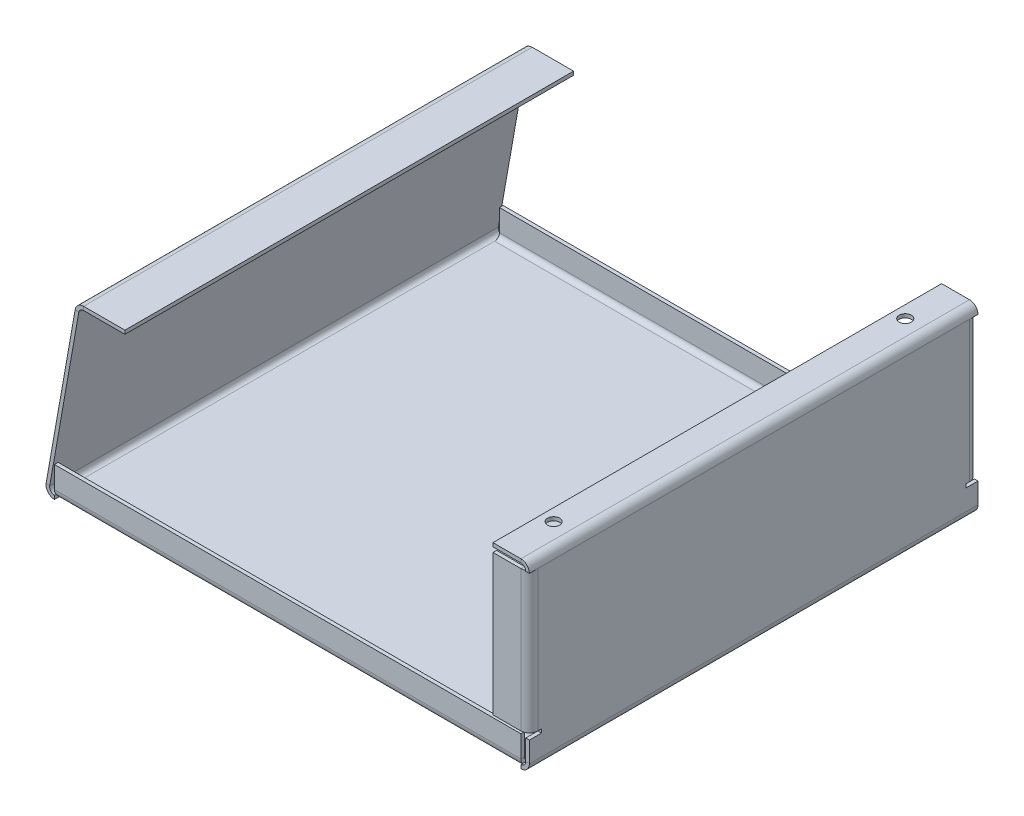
ISO-10303-21;
HEADER;
FILE_DESCRIPTION(('STEP AP214'),'2;1');
FILE_NAME('part.step','',(''),(''),'','','');
FILE_SCHEMA(('AUTOMOTIVE_DESIGN { 1 0 10303 214 1 1 1 1 }'));
ENDSEC;
DATA;
#1=APPLICATION_CONTEXT('core data for automotive mechanical design processes');
#2=APPLICATION_PROTOCOL_DEFINITION('international standard','automotive_design',2000,#1);
#3=PRODUCT_CONTEXT('',#1,'mechanical');
#4=PRODUCT('Part','Part','',(#3));
#5=PRODUCT_RELATED_PRODUCT_CATEGORY('part','',(#4));
#6=PRODUCT_DEFINITION_FORMATION('','',#4);
#7=PRODUCT_DEFINITION_CONTEXT('part definition',#1,'design');
#8=PRODUCT_DEFINITION('design','',#6,#7);
#9=PRODUCT_DEFINITION_SHAPE('','',#8);
#10=(LENGTH_UNIT() NAMED_UNIT(*) SI_UNIT(.MILLI.,.METRE.));
#11=(NAMED_UNIT(*) PLANE_ANGLE_UNIT() SI_UNIT($,.RADIAN.));
#12=(NAMED_UNIT(*) SI_UNIT($,.STERADIAN.) SOLID_ANGLE_UNIT());
#13=UNCERTAINTY_MEASURE_WITH_UNIT(LENGTH_MEASURE(1.E-05),#10,'distance_accuracy_value','');
#14=(GEOMETRIC_REPRESENTATION_CONTEXT(3) GLOBAL_UNCERTAINTY_ASSIGNED_CONTEXT((#13)) GLOBAL_UNIT_ASSIGNED_CONTEXT((#10,
#11,#12)) REPRESENTATION_CONTEXT('',''));
#15=CARTESIAN_POINT('',(0.,0.,0.));
#16=DIRECTION('',(0.,0.,1.));
#17=DIRECTION('',(1.,0.,0.));
#18=AXIS2_PLACEMENT_3D('',#15,#16,#17);
#19=CARTESIAN_POINT('',(197.,143.,6.99999999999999));
#20=DIRECTION('',(0.,-1.,0.));
#21=DIRECTION('',(0.,0.,-1.));
#22=AXIS2_PLACEMENT_3D('',#19,#20,#21);
#23=PLANE('',#22);
#24=DIRECTION('',(0.,0.,-1.));
#25=VECTOR('',#24,1.);
#26=CARTESIAN_POINT('',(200.,143.,370.));
#27=LINE('',#26,#25);
#28=CARTESIAN_POINT('',(200.,143.,7.00000000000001));
#29=VERTEX_POINT('',#28);
#30=CARTESIAN_POINT('',(200.,143.,0.));
#31=VERTEX_POINT('',#30);
#32=EDGE_CURVE('E572',#29,#31,#27,.T.);
#33=ORIENTED_EDGE('',*,*,#32,.F.);
#34=CARTESIAN_POINT('',(193.,143.,6.99999999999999));
#35=DIRECTION('',(0.,-1.,0.));
#36=DIRECTION('',(0.,0.,-1.));
#37=AXIS2_PLACEMENT_3D('',#34,#35,#36);
#38=CIRCLE('',#37,7.);
#39=CARTESIAN_POINT('',(197.,143.,1.25543735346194));
#40=VERTEX_POINT('',#39);
#41=EDGE_CURVE('E503',#29,#40,#38,.F.);
#42=ORIENTED_EDGE('',*,*,#41,.T.);
#43=DIRECTION('',(0.,0.,-1.));
#44=VECTOR('',#43,1.);
#45=CARTESIAN_POINT('',(197.,143.,6.99999999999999));
#46=LINE('',#45,#44);
#47=CARTESIAN_POINT('',(197.,143.,0.));
#48=VERTEX_POINT('',#47);
#49=EDGE_CURVE('E568',#40,#48,#46,.T.);
#50=ORIENTED_EDGE('',*,*,#49,.T.);
#51=DIRECTION('',(1.,0.,0.));
#52=VECTOR('',#51,1.);
#53=CARTESIAN_POINT('',(197.,143.,0.));
#54=LINE('',#53,#52);
#55=EDGE_CURVE('E925',#48,#31,#54,.T.);
#56=ORIENTED_EDGE('',*,*,#55,.T.);
#57=EDGE_LOOP('',(#33,#42,#50,#56));
#58=FACE_BOUND('',#57,.T.);
#59=ADVANCED_FACE('F117',(#58),#23,.T.);
#60=CARTESIAN_POINT('',(197.,143.,370.));
#61=DIRECTION('',(0.,-1.,0.));
#62=DIRECTION('',(0.,0.,-1.));
#63=AXIS2_PLACEMENT_3D('',#60,#61,#62);
#64=PLANE('',#63);
#65=DIRECTION('',(0.,0.,-1.));
#66=VECTOR('',#65,1.);
#67=CARTESIAN_POINT('',(197.,143.,370.));
#68=LINE('',#67,#66);
#69=CARTESIAN_POINT('',(197.,143.,370.));
#70=VERTEX_POINT('',#69);
#71=CARTESIAN_POINT('',(197.,143.,368.744562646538));
#72=VERTEX_POINT('',#71);
#73=EDGE_CURVE('E859',#70,#72,#68,.T.);
#74=ORIENTED_EDGE('',*,*,#73,.T.);
#75=CARTESIAN_POINT('',(193.,143.,363.));
#76=DIRECTION('',(0.,1.,0.));
#77=DIRECTION('',(0.,0.,1.));
#78=AXIS2_PLACEMENT_3D('',#75,#76,#77);
#79=CIRCLE('',#78,7.);
#80=CARTESIAN_POINT('',(200.,143.,363.));
#81=VERTEX_POINT('',#80);
#82=EDGE_CURVE('E13',#72,#81,#79,.T.);
#83=ORIENTED_EDGE('',*,*,#82,.T.);
#84=DIRECTION('',(0.,0.,-1.));
#85=VECTOR('',#84,1.);
#86=CARTESIAN_POINT('',(200.,143.,370.));
#87=LINE('',#86,#85);
#88=CARTESIAN_POINT('',(200.,143.,370.));
#89=VERTEX_POINT('',#88);
#90=EDGE_CURVE('E872',#89,#81,#87,.T.);
#91=ORIENTED_EDGE('',*,*,#90,.F.);
#92=DIRECTION('',(-1.,0.,0.));
#93=VECTOR('',#92,1.);
#94=CARTESIAN_POINT('',(200.,143.,370.));
#95=LINE('',#94,#93);
#96=EDGE_CURVE('E121',#89,#70,#95,.T.);
#97=ORIENTED_EDGE('',*,*,#96,.T.);
#98=EDGE_LOOP('',(#74,#83,#91,#97));
#99=FACE_BOUND('',#98,.T.);
#100=ADVANCED_FACE('F1008',(#99),#64,.T.);
#101=CARTESIAN_POINT('',(200.,0.,370.));
#102=DIRECTION('',(1.,0.,0.));
#103=DIRECTION('',(0.,0.,-1.));
#104=AXIS2_PLACEMENT_3D('',#101,#102,#103);
#105=PLANE('',#104);
#106=DIRECTION('',(0.,-1.,0.));
#107=VECTOR('',#106,1.);
#108=CARTESIAN_POINT('',(200.,0.,0.));
#109=LINE('',#108,#107);
#110=CARTESIAN_POINT('',(200.,24.,0.));
#111=VERTEX_POINT('',#110);
#112=CARTESIAN_POINT('',(200.,7.,0.));
#113=VERTEX_POINT('',#112);
#114=EDGE_CURVE('E807',#111,#113,#109,.T.);
#115=ORIENTED_EDGE('',*,*,#114,.F.);
#116=DIRECTION('',(0.,0.,1.));
#117=VECTOR('',#116,1.);
#118=CARTESIAN_POINT('',(200.,24.,370.));
#119=LINE('',#118,#117);
#120=CARTESIAN_POINT('',(200.,24.,10.));
#121=VERTEX_POINT('',#120);
#122=EDGE_CURVE('E143',#111,#121,#119,.T.);
#123=ORIENTED_EDGE('',*,*,#122,.T.);
#124=DIRECTION('',(0.,1.,0.));
#125=VECTOR('',#124,1.);
#126=CARTESIAN_POINT('',(200.,0.,10.));
#127=LINE('',#126,#125);
#128=CARTESIAN_POINT('',(200.,27.,10.));
#129=VERTEX_POINT('',#128);
#130=EDGE_CURVE('E594',#121,#129,#127,.T.);
#131=ORIENTED_EDGE('',*,*,#130,.T.);
#132=DIRECTION('',(0.,0.,-1.));
#133=VECTOR('',#132,1.);
#134=CARTESIAN_POINT('',(200.,27.,370.));
#135=LINE('',#134,#133);
#136=CARTESIAN_POINT('',(200.,27.,7.00000000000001));
#137=VERTEX_POINT('',#136);
#138=EDGE_CURVE('E592',#129,#137,#135,.T.);
#139=ORIENTED_EDGE('',*,*,#138,.T.);
#140=DIRECTION('',(0.,-1.,0.));
#141=VECTOR('',#140,1.);
#142=CARTESIAN_POINT('',(200.,27.,6.99999999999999));
#143=LINE('',#142,#141);
#144=EDGE_CURVE('E499',#137,#29,#143,.F.);
#145=ORIENTED_EDGE('',*,*,#144,.T.);
#146=EDGE_CURVE('E871',#81,#29,#87,.T.);
#147=ORIENTED_EDGE('',*,*,#146,.F.);
#148=DIRECTION('',(0.,1.,0.));
#149=VECTOR('',#148,1.);
#150=CARTESIAN_POINT('',(200.,143.,363.));
#151=LINE('',#150,#149);
#152=CARTESIAN_POINT('',(200.,27.,363.));
#153=VERTEX_POINT('',#152);
#154=EDGE_CURVE('E551',#81,#153,#151,.F.);
#155=ORIENTED_EDGE('',*,*,#154,.T.);
#156=DIRECTION('',(0.,0.,-1.));
#157=VECTOR('',#156,1.);
#158=CARTESIAN_POINT('',(200.,27.,370.));
#159=LINE('',#158,#157);
#160=CARTESIAN_POINT('',(200.,27.,360.));
#161=VERTEX_POINT('',#160);
#162=EDGE_CURVE('E618',#153,#161,#159,.T.);
#163=ORIENTED_EDGE('',*,*,#162,.T.);
#164=DIRECTION('',(0.,-1.,0.));
#165=VECTOR('',#164,1.);
#166=CARTESIAN_POINT('',(200.,0.,360.));
#167=LINE('',#166,#165);
#168=CARTESIAN_POINT('',(200.,24.,360.));
#169=VERTEX_POINT('',#168);
#170=EDGE_CURVE('E616',#161,#169,#167,.T.);
#171=ORIENTED_EDGE('',*,*,#170,.T.);
#172=DIRECTION('',(0.,0.,1.));
#173=VECTOR('',#172,1.);
#174=CARTESIAN_POINT('',(200.,24.,370.));
#175=LINE('',#174,#173);
#176=CARTESIAN_POINT('',(200.,24.,370.));
#177=VERTEX_POINT('',#176);
#178=EDGE_CURVE('E600',#169,#177,#175,.T.);
#179=ORIENTED_EDGE('',*,*,#178,.T.);
#180=DIRECTION('',(0.,-1.,0.));
#181=VECTOR('',#180,1.);
#182=CARTESIAN_POINT('',(200.,0.,370.));
#183=LINE('',#182,#181);
#184=CARTESIAN_POINT('',(200.,7.,370.));
#185=VERTEX_POINT('',#184);
#186=EDGE_CURVE('E756',#177,#185,#183,.T.);
#187=ORIENTED_EDGE('',*,*,#186,.T.);
#188=DIRECTION('',(0.,0.,-1.));
#189=VECTOR('',#188,1.);
#190=CARTESIAN_POINT('',(200.,7.,370.));
#191=LINE('',#190,#189);
#192=EDGE_CURVE('E875',#185,#113,#191,.T.);
#193=ORIENTED_EDGE('',*,*,#192,.T.);
#194=EDGE_LOOP('',(#115,#123,#131,#139,#145,#147,#155,#163,#171,#179,#187,#193));
#195=FACE_BOUND('',#194,.T.);
#196=ADVANCED_FACE('F1014',(#195),#105,.T.);
#197=CARTESIAN_POINT('',(197.,0.,370.));
#198=DIRECTION('',(1.,0.,0.));
#199=DIRECTION('',(0.,0.,-1.));
#200=AXIS2_PLACEMENT_3D('',#197,#198,#199);
#201=PLANE('',#200);
#202=DIRECTION('',(0.,0.,1.));
#203=VECTOR('',#202,1.);
#204=CARTESIAN_POINT('',(197.,24.,0.));
#205=LINE('',#204,#203);
#206=CARTESIAN_POINT('',(197.,24.,0.));
#207=VERTEX_POINT('',#206);
#208=CARTESIAN_POINT('',(197.,24.,10.));
#209=VERTEX_POINT('',#208);
#210=EDGE_CURVE('E569',#207,#209,#205,.T.);
#211=ORIENTED_EDGE('',*,*,#210,.F.);
#212=DIRECTION('',(0.,1.,0.));
#213=VECTOR('',#212,1.);
#214=CARTESIAN_POINT('',(197.,0.,0.));
#215=LINE('',#214,#213);
#216=CARTESIAN_POINT('',(197.,7.,0.));
#217=VERTEX_POINT('',#216);
#218=EDGE_CURVE('E824',#207,#217,#215,.F.);
#219=ORIENTED_EDGE('',*,*,#218,.T.);
#220=DIRECTION('',(0.,0.,-1.));
#221=VECTOR('',#220,1.);
#222=CARTESIAN_POINT('',(197.,7.,370.));
#223=LINE('',#222,#221);
#224=CARTESIAN_POINT('',(197.,7.,370.));
#225=VERTEX_POINT('',#224);
#226=EDGE_CURVE('E854',#225,#217,#223,.T.);
#227=ORIENTED_EDGE('',*,*,#226,.F.);
#228=DIRECTION('',(0.,1.,0.));
#229=VECTOR('',#228,1.);
#230=CARTESIAN_POINT('',(197.,0.,370.));
#231=LINE('',#230,#229);
#232=CARTESIAN_POINT('',(197.,24.,370.));
#233=VERTEX_POINT('',#232);
#234=EDGE_CURVE('E772',#233,#225,#231,.F.);
#235=ORIENTED_EDGE('',*,*,#234,.F.);
#236=DIRECTION('',(0.,0.,1.));
#237=VECTOR('',#236,1.);
#238=CARTESIAN_POINT('',(197.,24.,360.));
#239=LINE('',#238,#237);
#240=CARTESIAN_POINT('',(197.,24.,360.));
#241=VERTEX_POINT('',#240);
#242=EDGE_CURVE('E605',#241,#233,#239,.T.);
#243=ORIENTED_EDGE('',*,*,#242,.F.);
#244=DIRECTION('',(0.,-1.,0.));
#245=VECTOR('',#244,1.);
#246=CARTESIAN_POINT('',(197.,27.,360.));
#247=LINE('',#246,#245);
#248=CARTESIAN_POINT('',(197.,27.,360.));
#249=VERTEX_POINT('',#248);
#250=EDGE_CURVE('E601',#249,#241,#247,.T.);
#251=ORIENTED_EDGE('',*,*,#250,.F.);
#252=DIRECTION('',(0.,0.,-1.));
#253=VECTOR('',#252,1.);
#254=CARTESIAN_POINT('',(197.,27.,363.));
#255=LINE('',#254,#253);
#256=CARTESIAN_POINT('',(197.,27.,363.));
#257=VERTEX_POINT('',#256);
#258=EDGE_CURVE('E597',#257,#249,#255,.T.);
#259=ORIENTED_EDGE('',*,*,#258,.F.);
#260=DIRECTION('',(0.,1.,0.));
#261=VECTOR('',#260,1.);
#262=CARTESIAN_POINT('',(197.,143.,363.));
#263=LINE('',#262,#261);
#264=CARTESIAN_POINT('',(197.,143.,363.));
#265=VERTEX_POINT('',#264);
#266=EDGE_CURVE('E561',#265,#257,#263,.F.);
#267=ORIENTED_EDGE('',*,*,#266,.F.);
#268=CARTESIAN_POINT('',(197.,143.,7.00000000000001));
#269=VERTEX_POINT('',#268);
#270=EDGE_CURVE('E858',#265,#269,#68,.T.);
#271=ORIENTED_EDGE('',*,*,#270,.T.);
#272=DIRECTION('',(0.,-1.,0.));
#273=VECTOR('',#272,1.);
#274=CARTESIAN_POINT('',(197.,27.,6.99999999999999));
#275=LINE('',#274,#273);
#276=CARTESIAN_POINT('',(197.,27.,7.00000000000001));
#277=VERTEX_POINT('',#276);
#278=EDGE_CURVE('E512',#277,#269,#275,.F.);
#279=ORIENTED_EDGE('',*,*,#278,.F.);
#280=DIRECTION('',(0.,0.,-1.));
#281=VECTOR('',#280,1.);
#282=CARTESIAN_POINT('',(197.,27.,9.99999999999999));
#283=LINE('',#282,#281);
#284=CARTESIAN_POINT('',(197.,27.,10.));
#285=VERTEX_POINT('',#284);
#286=EDGE_CURVE('E578',#285,#277,#283,.T.);
#287=ORIENTED_EDGE('',*,*,#286,.F.);
#288=DIRECTION('',(0.,1.,0.));
#289=VECTOR('',#288,1.);
#290=CARTESIAN_POINT('',(197.,24.,9.99999999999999));
#291=LINE('',#290,#289);
#292=EDGE_CURVE('E574',#209,#285,#291,.T.);
#293=ORIENTED_EDGE('',*,*,#292,.F.);
#294=EDGE_LOOP('',(#211,#219,#227,#235,#243,#251,#259,#267,#271,#279,#287,#293));
#295=FACE_BOUND('',#294,.T.);
#296=ADVANCED_FACE('F1111',(#295),#201,.F.);
#297=CARTESIAN_POINT('',(193.,3.,0.));
#298=DIRECTION('',(0.,0.,-1.));
#299=DIRECTION('',(-1.,0.,0.));
#300=AXIS2_PLACEMENT_3D('',#297,#298,#299);
#301=PLANE('',#300);
#302=ORIENTED_EDGE('',*,*,#218,.F.);
#303=DIRECTION('',(1.,0.,0.));
#304=VECTOR('',#303,1.);
#305=CARTESIAN_POINT('',(197.,24.,0.));
#306=LINE('',#305,#304);
#307=EDGE_CURVE('E573',#207,#111,#306,.T.);
#308=ORIENTED_EDGE('',*,*,#307,.T.);
#309=ORIENTED_EDGE('',*,*,#114,.T.);
#310=DIRECTION('',(-1.,0.,0.));
#311=VECTOR('',#310,1.);
#312=CARTESIAN_POINT('',(200.,7.,0.));
#313=LINE('',#312,#311);
#314=EDGE_CURVE('E917',#113,#217,#313,.T.);
#315=ORIENTED_EDGE('',*,*,#314,.T.);
#316=EDGE_LOOP('',(#302,#308,#309,#315));
#317=FACE_BOUND('',#316,.T.);
#318=ADVANCED_FACE('F1173',(#317),#301,.T.);
#319=CARTESIAN_POINT('',(193.,147.,370.));
#320=DIRECTION('',(0.,0.,1.));
#321=DIRECTION('',(1.,0.,0.));
#322=AXIS2_PLACEMENT_3D('',#319,#320,#321);
#323=PLANE('',#322);
#324=ORIENTED_EDGE('',*,*,#186,.F.);
#325=DIRECTION('',(1.,0.,0.));
#326=VECTOR('',#325,1.);
#327=CARTESIAN_POINT('',(197.,24.,370.));
#328=LINE('',#327,#326);
#329=EDGE_CURVE('E608',#233,#177,#328,.T.);
#330=ORIENTED_EDGE('',*,*,#329,.F.);
#331=ORIENTED_EDGE('',*,*,#234,.T.);
#332=DIRECTION('',(1.,0.,0.));
#333=VECTOR('',#332,1.);
#334=CARTESIAN_POINT('',(197.,7.,370.));
#335=LINE('',#334,#333);
#336=EDGE_CURVE('E920',#225,#185,#335,.T.);
#337=ORIENTED_EDGE('',*,*,#336,.T.);
#338=EDGE_LOOP('',(#324,#330,#331,#337));
#339=FACE_BOUND('',#338,.T.);
#340=ADVANCED_FACE('F1190',(#339),#323,.T.);
#341=CARTESIAN_POINT('',(193.,2.99999999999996,6.99999999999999));
#342=DIRECTION('',(-1.,0.,0.));
#343=DIRECTION('',(0.,0.,1.));
#344=AXIS2_PLACEMENT_3D('',#341,#342,#343);
#345=PLANE('',#344);
#346=DIRECTION('',(0.,0.,-1.));
#347=VECTOR('',#346,1.);
#348=CARTESIAN_POINT('',(193.,0.,370.));
#349=LINE('',#348,#347);
#350=CARTESIAN_POINT('',(193.,0.,6.99999999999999));
#351=VERTEX_POINT('',#350);
#352=CARTESIAN_POINT('',(193.,0.,0.));
#353=VERTEX_POINT('',#352);
#354=EDGE_CURVE('E731',#351,#353,#349,.T.);
#355=ORIENTED_EDGE('',*,*,#354,.F.);
#356=CARTESIAN_POINT('',(193.,6.99999999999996,6.99999999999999));
#357=DIRECTION('',(-1.,0.,0.));
#358=DIRECTION('',(0.,0.,1.));
#359=AXIS2_PLACEMENT_3D('',#356,#357,#358);
#360=CIRCLE('',#359,7.);
#361=CARTESIAN_POINT('',(193.,2.99999999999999,1.25543735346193));
#362=VERTEX_POINT('',#361);
#363=EDGE_CURVE('E657',#351,#362,#360,.F.);
#364=ORIENTED_EDGE('',*,*,#363,.T.);
#365=DIRECTION('',(0.,0.,-1.));
#366=VECTOR('',#365,1.);
#367=CARTESIAN_POINT('',(193.,2.99999999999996,6.99999999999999));
#368=LINE('',#367,#366);
#369=CARTESIAN_POINT('',(193.,3.,0.));
#370=VERTEX_POINT('',#369);
#371=EDGE_CURVE('E709',#362,#370,#368,.T.);
#372=ORIENTED_EDGE('',*,*,#371,.T.);
#373=DIRECTION('',(0.,-1.,0.));
#374=VECTOR('',#373,1.);
#375=CARTESIAN_POINT('',(193.,3.,0.));
#376=LINE('',#375,#374);
#377=EDGE_CURVE('E915',#370,#353,#376,.T.);
#378=ORIENTED_EDGE('',*,*,#377,.T.);
#379=EDGE_LOOP('',(#355,#364,#372,#378));
#380=FACE_BOUND('',#379,.T.);
#381=ADVANCED_FACE('F960',(#380),#345,.T.);
#382=CARTESIAN_POINT('',(-191.657724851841,3.,0.));
#383=DIRECTION('',(1.,0.,0.));
#384=DIRECTION('',(0.,0.,-1.));
#385=AXIS2_PLACEMENT_3D('',#382,#383,#384);
#386=PLANE('',#385);
#387=DIRECTION('',(0.,0.,1.));
#388=VECTOR('',#387,1.);
#389=CARTESIAN_POINT('',(-191.657724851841,3.,0.));
#390=LINE('',#389,#388);
#391=CARTESIAN_POINT('',(-191.657724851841,3.,0.));
#392=VERTEX_POINT('',#391);
#393=CARTESIAN_POINT('',(-191.657724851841,2.99999999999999,1.25543735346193));
#394=VERTEX_POINT('',#393);
#395=EDGE_CURVE('E721',#392,#394,#390,.T.);
#396=ORIENTED_EDGE('',*,*,#395,.T.);
#397=CARTESIAN_POINT('',(-191.657724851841,6.99999999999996,6.99999999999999));
#398=DIRECTION('',(-1.,0.,0.));
#399=DIRECTION('',(0.,0.,1.));
#400=AXIS2_PLACEMENT_3D('',#397,#398,#399);
#401=CIRCLE('',#400,7.);
#402=CARTESIAN_POINT('',(-191.657724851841,0.,7.00000000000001));
#403=VERTEX_POINT('',#402);
#404=EDGE_CURVE('E126',#394,#403,#401,.T.);
#405=ORIENTED_EDGE('',*,*,#404,.T.);
#406=DIRECTION('',(0.,0.,-1.));
#407=VECTOR('',#406,1.);
#408=CARTESIAN_POINT('',(-191.657724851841,0.,370.));
#409=LINE('',#408,#407);
#410=CARTESIAN_POINT('',(-191.657724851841,0.,0.));
#411=VERTEX_POINT('',#410);
#412=EDGE_CURVE('E724',#411,#403,#409,.F.);
#413=ORIENTED_EDGE('',*,*,#412,.F.);
#414=DIRECTION('',(0.,1.,0.));
#415=VECTOR('',#414,1.);
#416=CARTESIAN_POINT('',(-191.657724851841,0.,0.));
#417=LINE('',#416,#415);
#418=EDGE_CURVE('E909',#411,#392,#417,.T.);
#419=ORIENTED_EDGE('',*,*,#418,.T.);
#420=EDGE_LOOP('',(#396,#405,#413,#419));
#421=FACE_BOUND('',#420,.T.);
#422=ADVANCED_FACE('F941',(#421),#386,.T.);
#423=CARTESIAN_POINT('',(193.,3.,370.));
#424=DIRECTION('',(-1.,0.,0.));
#425=DIRECTION('',(0.,0.,1.));
#426=AXIS2_PLACEMENT_3D('',#423,#424,#425);
#427=PLANE('',#426);
#428=DIRECTION('',(0.,0.,-1.));
#429=VECTOR('',#428,1.);
#430=CARTESIAN_POINT('',(193.,3.,370.));
#431=LINE('',#430,#429);
#432=CARTESIAN_POINT('',(193.,3.,370.));
#433=VERTEX_POINT('',#432);
#434=CARTESIAN_POINT('',(193.,3.,368.744562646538));
#435=VERTEX_POINT('',#434);
#436=EDGE_CURVE('E851',#433,#435,#431,.T.);
#437=ORIENTED_EDGE('',*,*,#436,.T.);
#438=CARTESIAN_POINT('',(193.,7.00000000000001,363.));
#439=DIRECTION('',(1.,0.,0.));
#440=DIRECTION('',(0.,0.,-1.));
#441=AXIS2_PLACEMENT_3D('',#438,#439,#440);
#442=CIRCLE('',#441,7.);
#443=CARTESIAN_POINT('',(193.,0.,363.));
#444=VERTEX_POINT('',#443);
#445=EDGE_CURVE('E713',#435,#444,#442,.T.);
#446=ORIENTED_EDGE('',*,*,#445,.T.);
#447=DIRECTION('',(0.,0.,-1.));
#448=VECTOR('',#447,1.);
#449=CARTESIAN_POINT('',(193.,0.,370.));
#450=LINE('',#449,#448);
#451=CARTESIAN_POINT('',(193.,0.,370.));
#452=VERTEX_POINT('',#451);
#453=EDGE_CURVE('E879',#452,#444,#450,.T.);
#454=ORIENTED_EDGE('',*,*,#453,.F.);
#455=DIRECTION('',(0.,1.,0.));
#456=VECTOR('',#455,1.);
#457=CARTESIAN_POINT('',(193.,0.,370.));
#458=LINE('',#457,#456);
#459=EDGE_CURVE('E923',#452,#433,#458,.T.);
#460=ORIENTED_EDGE('',*,*,#459,.T.);
#461=EDGE_LOOP('',(#437,#446,#454,#460));
#462=FACE_BOUND('',#461,.T.);
#463=ADVANCED_FACE('F1195',(#462),#427,.T.);
#464=CARTESIAN_POINT('',(-191.657724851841,3.,363.));
#465=DIRECTION('',(1.,0.,0.));
#466=DIRECTION('',(0.,0.,-1.));
#467=AXIS2_PLACEMENT_3D('',#464,#465,#466);
#468=PLANE('',#467);
#469=DIRECTION('',(0.,0.,-1.));
#470=VECTOR('',#469,1.);
#471=CARTESIAN_POINT('',(-191.657724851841,0.,370.));
#472=LINE('',#471,#470);
#473=CARTESIAN_POINT('',(-191.657724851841,0.,370.));
#474=VERTEX_POINT('',#473);
#475=CARTESIAN_POINT('',(-191.657724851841,0.,363.));
#476=VERTEX_POINT('',#475);
#477=EDGE_CURVE('E883',#474,#476,#472,.T.);
#478=ORIENTED_EDGE('',*,*,#477,.T.);
#479=CARTESIAN_POINT('',(-191.657724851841,7.00000000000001,363.));
#480=DIRECTION('',(1.,0.,0.));
#481=DIRECTION('',(0.,0.,-1.));
#482=AXIS2_PLACEMENT_3D('',#479,#480,#481);
#483=CIRCLE('',#482,7.);
#484=CARTESIAN_POINT('',(-191.657724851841,3.,368.744562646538));
#485=VERTEX_POINT('',#484);
#486=EDGE_CURVE('E706',#476,#485,#483,.F.);
#487=ORIENTED_EDGE('',*,*,#486,.T.);
#488=DIRECTION('',(0.,0.,-1.));
#489=VECTOR('',#488,1.);
#490=CARTESIAN_POINT('',(-191.657724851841,3.,370.));
#491=LINE('',#490,#489);
#492=CARTESIAN_POINT('',(-191.657724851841,3.,370.));
#493=VERTEX_POINT('',#492);
#494=EDGE_CURVE('E846',#493,#485,#491,.T.);
#495=ORIENTED_EDGE('',*,*,#494,.F.);
#496=DIRECTION('',(0.,-1.,0.));
#497=VECTOR('',#496,1.);
#498=CARTESIAN_POINT('',(-191.657724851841,3.,370.));
#499=LINE('',#498,#497);
#500=EDGE_CURVE('E911',#493,#474,#499,.T.);
#501=ORIENTED_EDGE('',*,*,#500,.T.);
#502=EDGE_LOOP('',(#478,#487,#495,#501));
#503=FACE_BOUND('',#502,.T.);
#504=ADVANCED_FACE('F1217',(#503),#468,.T.);
#505=CARTESIAN_POINT('',(-200.,0.,370.));
#506=DIRECTION('',(0.,-1.,0.));
#507=DIRECTION('',(0.,0.,-1.));
#508=AXIS2_PLACEMENT_3D('',#505,#506,#507);
#509=PLANE('',#508);
#510=EDGE_CURVE('E882',#476,#403,#472,.T.);
#511=ORIENTED_EDGE('',*,*,#510,.T.);
#512=DIRECTION('',(-1.,0.,0.));
#513=VECTOR('',#512,1.);
#514=CARTESIAN_POINT('',(-191.657724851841,0.,6.99999999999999));
#515=LINE('',#514,#513);
#516=EDGE_CURVE('E652',#403,#351,#515,.F.);
#517=ORIENTED_EDGE('',*,*,#516,.T.);
#518=EDGE_CURVE('E878',#444,#351,#450,.T.);
#519=ORIENTED_EDGE('',*,*,#518,.F.);
#520=DIRECTION('',(1.,0.,0.));
#521=VECTOR('',#520,1.);
#522=CARTESIAN_POINT('',(193.,0.,363.));
#523=LINE('',#522,#521);
#524=EDGE_CURVE('E701',#444,#476,#523,.F.);
#525=ORIENTED_EDGE('',*,*,#524,.T.);
#526=EDGE_LOOP('',(#511,#517,#519,#525));
#527=FACE_BOUND('',#526,.T.);
#528=ADVANCED_FACE('F953',(#527),#509,.T.);
#529=CARTESIAN_POINT('',(-200.,3.,370.));
#530=DIRECTION('',(0.,-1.,0.));
#531=DIRECTION('',(0.,0.,-1.));
#532=AXIS2_PLACEMENT_3D('',#529,#530,#531);
#533=PLANE('',#532);
#534=DIRECTION('',(-1.,0.,0.));
#535=VECTOR('',#534,1.);
#536=CARTESIAN_POINT('',(-191.657724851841,2.99999999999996,6.99999999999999));
#537=LINE('',#536,#535);
#538=CARTESIAN_POINT('',(-191.657724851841,2.99999999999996,6.99999999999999));
#539=VERTEX_POINT('',#538);
#540=CARTESIAN_POINT('',(193.,2.99999999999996,6.99999999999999));
#541=VERTEX_POINT('',#540);
#542=EDGE_CURVE('E665',#539,#541,#537,.F.);
#543=ORIENTED_EDGE('',*,*,#542,.F.);
#544=CARTESIAN_POINT('',(-191.657724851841,3.,363.));
#545=VERTEX_POINT('',#544);
#546=EDGE_CURVE('E845',#545,#539,#491,.T.);
#547=ORIENTED_EDGE('',*,*,#546,.F.);
#548=DIRECTION('',(1.,0.,0.));
#549=VECTOR('',#548,1.);
#550=CARTESIAN_POINT('',(193.,3.,363.));
#551=LINE('',#550,#549);
#552=CARTESIAN_POINT('',(193.,3.,363.));
#553=VERTEX_POINT('',#552);
#554=EDGE_CURVE('E716',#553,#545,#551,.F.);
#555=ORIENTED_EDGE('',*,*,#554,.F.);
#556=EDGE_CURVE('E849',#553,#541,#431,.T.);
#557=ORIENTED_EDGE('',*,*,#556,.T.);
#558=EDGE_LOOP('',(#543,#547,#555,#557));
#559=FACE_BOUND('',#558,.T.);
#560=ADVANCED_FACE('F1201',(#559),#533,.F.);
#561=CARTESIAN_POINT('',(200.,143.,370.));
#562=DIRECTION('',(0.,0.,1.));
#563=DIRECTION('',(1.,0.,0.));
#564=AXIS2_PLACEMENT_3D('',#561,#562,#563);
#565=PLANE('',#564);
#566=ORIENTED_EDGE('',*,*,#96,.F.);
#567=CARTESIAN_POINT('',(193.,143.,370.));
#568=DIRECTION('',(0.,0.,1.));
#569=DIRECTION('',(1.,0.,0.));
#570=AXIS2_PLACEMENT_3D('',#567,#568,#569);
#571=CIRCLE('',#570,7.);
#572=CARTESIAN_POINT('',(193.,150.,370.));
#573=VERTEX_POINT('',#572);
#574=EDGE_CURVE('E758',#573,#89,#571,.F.);
#575=ORIENTED_EDGE('',*,*,#574,.F.);
#576=DIRECTION('',(0.,1.,0.));
#577=VECTOR('',#576,1.);
#578=CARTESIAN_POINT('',(193.,147.,370.));
#579=LINE('',#578,#577);
#580=CARTESIAN_POINT('',(193.,147.,370.));
#581=VERTEX_POINT('',#580);
#582=EDGE_CURVE('E929',#581,#573,#579,.T.);
#583=ORIENTED_EDGE('',*,*,#582,.F.);
#584=CARTESIAN_POINT('',(193.,143.,370.));
#585=DIRECTION('',(0.,0.,1.));
#586=DIRECTION('',(1.,0.,0.));
#587=AXIS2_PLACEMENT_3D('',#584,#585,#586);
#588=CIRCLE('',#587,4.);
#589=EDGE_CURVE('E770',#581,#70,#588,.F.);
#590=ORIENTED_EDGE('',*,*,#589,.T.);
#591=EDGE_LOOP('',(#566,#575,#583,#590));
#592=FACE_BOUND('',#591,.T.);
#593=ADVANCED_FACE('F119',(#592),#565,.T.);
#594=CARTESIAN_POINT('',(193.,150.,0.));
#595=DIRECTION('',(0.,0.,-1.));
#596=DIRECTION('',(-1.,0.,0.));
#597=AXIS2_PLACEMENT_3D('',#594,#595,#596);
#598=PLANE('',#597);
#599=DIRECTION('',(0.,-1.,0.));
#600=VECTOR('',#599,1.);
#601=CARTESIAN_POINT('',(193.,150.,0.));
#602=LINE('',#601,#600);
#603=CARTESIAN_POINT('',(193.,150.,0.));
#604=VERTEX_POINT('',#603);
#605=CARTESIAN_POINT('',(193.,147.,0.));
#606=VERTEX_POINT('',#605);
#607=EDGE_CURVE('E928',#604,#606,#602,.T.);
#608=ORIENTED_EDGE('',*,*,#607,.F.);
#609=CARTESIAN_POINT('',(193.,143.,0.));
#610=DIRECTION('',(0.,0.,1.));
#611=DIRECTION('',(1.,0.,0.));
#612=AXIS2_PLACEMENT_3D('',#609,#610,#611);
#613=CIRCLE('',#612,7.);
#614=EDGE_CURVE('E809',#604,#31,#613,.F.);
#615=ORIENTED_EDGE('',*,*,#614,.T.);
#616=ORIENTED_EDGE('',*,*,#55,.F.);
#617=CARTESIAN_POINT('',(193.,143.,0.));
#618=DIRECTION('',(0.,0.,1.));
#619=DIRECTION('',(1.,0.,0.));
#620=AXIS2_PLACEMENT_3D('',#617,#618,#619);
#621=CIRCLE('',#620,4.);
#622=EDGE_CURVE('E821',#606,#48,#621,.F.);
#623=ORIENTED_EDGE('',*,*,#622,.F.);
#624=EDGE_LOOP('',(#608,#615,#616,#623));
#625=FACE_BOUND('',#624,.T.);
#626=ADVANCED_FACE('F1160',(#625),#598,.T.);
#627=CARTESIAN_POINT('',(197.,143.,0.));
#628=DIRECTION('',(0.,0.,-1.));
#629=DIRECTION('',(-1.,0.,0.));
#630=AXIS2_PLACEMENT_3D('',#627,#628,#629);
#631=PLANE('',#630);
#632=DIRECTION('',(1.,0.,0.));
#633=VECTOR('',#632,1.);
#634=CARTESIAN_POINT('',(200.,150.,0.));
#635=LINE('',#634,#633);
#636=CARTESIAN_POINT('',(170.,150.,0.));
#637=VERTEX_POINT('',#636);
#638=EDGE_CURVE('E812',#637,#604,#635,.T.);
#639=ORIENTED_EDGE('',*,*,#638,.T.);
#640=ORIENTED_EDGE('',*,*,#607,.T.);
#641=DIRECTION('',(1.,0.,0.));
#642=VECTOR('',#641,1.);
#643=CARTESIAN_POINT('',(200.,147.,0.));
#644=LINE('',#643,#642);
#645=CARTESIAN_POINT('',(170.,147.,0.));
#646=VERTEX_POINT('',#645);
#647=EDGE_CURVE('E818',#646,#606,#644,.T.);
#648=ORIENTED_EDGE('',*,*,#647,.F.);
#649=DIRECTION('',(0.,1.,0.));
#650=VECTOR('',#649,1.);
#651=CARTESIAN_POINT('',(170.,147.,0.));
#652=LINE('',#651,#650);
#653=EDGE_CURVE('E815',#646,#637,#652,.T.);
#654=ORIENTED_EDGE('',*,*,#653,.T.);
#655=EDGE_LOOP('',(#639,#640,#648,#654));
#656=FACE_BOUND('',#655,.T.);
#657=ADVANCED_FACE('F1296',(#656),#631,.T.);
#658=CARTESIAN_POINT('',(193.,0.,370.));
#659=DIRECTION('',(0.,0.,1.));
#660=DIRECTION('',(1.,0.,0.));
#661=AXIS2_PLACEMENT_3D('',#658,#659,#660);
#662=PLANE('',#661);
#663=ORIENTED_EDGE('',*,*,#459,.F.);
#664=CARTESIAN_POINT('',(193.,7.,370.));
#665=DIRECTION('',(0.,0.,1.));
#666=DIRECTION('',(1.,0.,0.));
#667=AXIS2_PLACEMENT_3D('',#664,#665,#666);
#668=CIRCLE('',#667,7.);
#669=EDGE_CURVE('E753',#185,#452,#668,.F.);
#670=ORIENTED_EDGE('',*,*,#669,.F.);
#671=ORIENTED_EDGE('',*,*,#336,.F.);
#672=CARTESIAN_POINT('',(193.,7.,370.));
#673=DIRECTION('',(0.,0.,1.));
#674=DIRECTION('',(1.,0.,0.));
#675=AXIS2_PLACEMENT_3D('',#672,#673,#674);
#676=CIRCLE('',#675,4.);
#677=EDGE_CURVE('E774',#225,#433,#676,.F.);
#678=ORIENTED_EDGE('',*,*,#677,.T.);
#679=EDGE_LOOP('',(#663,#670,#671,#678));
#680=FACE_BOUND('',#679,.T.);
#681=ADVANCED_FACE('F1194',(#680),#662,.T.);
#682=CARTESIAN_POINT('',(200.,7.,0.));
#683=DIRECTION('',(0.,0.,-1.));
#684=DIRECTION('',(-1.,0.,0.));
#685=AXIS2_PLACEMENT_3D('',#682,#683,#684);
#686=PLANE('',#685);
#687=ORIENTED_EDGE('',*,*,#314,.F.);
#688=CARTESIAN_POINT('',(193.,7.,0.));
#689=DIRECTION('',(0.,0.,1.));
#690=DIRECTION('',(1.,0.,0.));
#691=AXIS2_PLACEMENT_3D('',#688,#689,#690);
#692=CIRCLE('',#691,7.);
#693=EDGE_CURVE('E804',#113,#353,#692,.F.);
#694=ORIENTED_EDGE('',*,*,#693,.T.);
#695=ORIENTED_EDGE('',*,*,#377,.F.);
#696=CARTESIAN_POINT('',(193.,7.,0.));
#697=DIRECTION('',(0.,0.,1.));
#698=DIRECTION('',(1.,0.,0.));
#699=AXIS2_PLACEMENT_3D('',#696,#697,#698);
#700=CIRCLE('',#699,4.);
#701=EDGE_CURVE('E826',#217,#370,#700,.F.);
#702=ORIENTED_EDGE('',*,*,#701,.F.);
#703=EDGE_LOOP('',(#687,#694,#695,#702));
#704=FACE_BOUND('',#703,.T.);
#705=ADVANCED_FACE('F1182',(#704),#686,.T.);
#706=CARTESIAN_POINT('',(-198.551379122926,8.21553724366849,370.));
#707=DIRECTION('',(0.,0.,1.));
#708=DIRECTION('',(1.,0.,0.));
#709=AXIS2_PLACEMENT_3D('',#706,#707,#708);
#710=PLANE('',#709);
#711=DIRECTION('',(0.984807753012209,-0.173648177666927,0.));
#712=VECTOR('',#711,1.);
#713=CARTESIAN_POINT('',(-198.551379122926,8.21553724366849,370.));
#714=LINE('',#713,#712);
#715=CARTESIAN_POINT('',(-198.551379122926,8.21553724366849,370.));
#716=VERTEX_POINT('',#715);
#717=CARTESIAN_POINT('',(-195.596955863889,7.6945927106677,370.));
#718=VERTEX_POINT('',#717);
#719=EDGE_CURVE('E913',#716,#718,#714,.T.);
#720=ORIENTED_EDGE('',*,*,#719,.F.);
#721=CARTESIAN_POINT('',(-191.657724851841,7.,370.));
#722=DIRECTION('',(0.,0.,1.));
#723=DIRECTION('',(1.,0.,0.));
#724=AXIS2_PLACEMENT_3D('',#721,#722,#723);
#725=CIRCLE('',#724,7.);
#726=EDGE_CURVE('E750',#474,#716,#725,.F.);
#727=ORIENTED_EDGE('',*,*,#726,.F.);
#728=ORIENTED_EDGE('',*,*,#500,.F.);
#729=CARTESIAN_POINT('',(-191.657724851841,7.,370.));
#730=DIRECTION('',(0.,0.,1.));
#731=DIRECTION('',(1.,0.,0.));
#732=AXIS2_PLACEMENT_3D('',#729,#730,#731);
#733=CIRCLE('',#732,4.);
#734=EDGE_CURVE('E777',#493,#718,#733,.F.);
#735=ORIENTED_EDGE('',*,*,#734,.T.);
#736=EDGE_LOOP('',(#720,#727,#728,#735));
#737=FACE_BOUND('',#736,.T.);
#738=ADVANCED_FACE('F1221',(#737),#710,.T.);
#739=CARTESIAN_POINT('',(-191.657724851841,3.,370.));
#740=DIRECTION('',(0.,0.,1.));
#741=DIRECTION('',(1.,0.,0.));
#742=AXIS2_PLACEMENT_3D('',#739,#740,#741);
#743=PLANE('',#742);
#744=DIRECTION('',(0.173648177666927,0.984807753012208,0.));
#745=VECTOR('',#744,1.);
#746=CARTESIAN_POINT('',(-200.,0.,370.));
#747=LINE('',#746,#745);
#748=CARTESIAN_POINT('',(-174.570909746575,144.215537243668,370.));
#749=VERTEX_POINT('',#748);
#750=EDGE_CURVE('E747',#716,#749,#747,.T.);
#751=ORIENTED_EDGE('',*,*,#750,.F.);
#752=ORIENTED_EDGE('',*,*,#719,.T.);
#753=DIRECTION('',(0.173648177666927,0.984807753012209,0.));
#754=VECTOR('',#753,1.);
#755=CARTESIAN_POINT('',(-197.045576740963,-0.520944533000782,370.));
#756=LINE('',#755,#754);
#757=CARTESIAN_POINT('',(-171.616486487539,143.694592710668,370.));
#758=VERTEX_POINT('',#757);
#759=EDGE_CURVE('E780',#718,#758,#756,.T.);
#760=ORIENTED_EDGE('',*,*,#759,.T.);
#761=DIRECTION('',(-0.98480775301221,0.173648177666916,0.));
#762=VECTOR('',#761,1.);
#763=CARTESIAN_POINT('',(-171.616486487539,143.694592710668,370.));
#764=LINE('',#763,#762);
#765=EDGE_CURVE('E903',#758,#749,#764,.T.);
#766=ORIENTED_EDGE('',*,*,#765,.T.);
#767=EDGE_LOOP('',(#751,#752,#760,#766));
#768=FACE_BOUND('',#767,.T.);
#769=ADVANCED_FACE('F1229',(#768),#743,.T.);
#770=CARTESIAN_POINT('',(-191.657724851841,0.,0.));
#771=DIRECTION('',(0.,0.,-1.));
#772=DIRECTION('',(-1.,0.,0.));
#773=AXIS2_PLACEMENT_3D('',#770,#771,#772);
#774=PLANE('',#773);
#775=ORIENTED_EDGE('',*,*,#418,.F.);
#776=CARTESIAN_POINT('',(-191.657724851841,7.,0.));
#777=DIRECTION('',(0.,0.,1.));
#778=DIRECTION('',(1.,0.,0.));
#779=AXIS2_PLACEMENT_3D('',#776,#777,#778);
#780=CIRCLE('',#779,7.);
#781=CARTESIAN_POINT('',(-198.551379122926,8.21553724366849,0.));
#782=VERTEX_POINT('',#781);
#783=EDGE_CURVE('E801',#411,#782,#780,.F.);
#784=ORIENTED_EDGE('',*,*,#783,.T.);
#785=DIRECTION('',(-0.984807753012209,0.173648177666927,0.));
#786=VECTOR('',#785,1.);
#787=CARTESIAN_POINT('',(-195.596955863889,7.6945927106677,0.));
#788=LINE('',#787,#786);
#789=CARTESIAN_POINT('',(-195.596955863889,7.6945927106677,0.));
#790=VERTEX_POINT('',#789);
#791=EDGE_CURVE('E907',#790,#782,#788,.T.);
#792=ORIENTED_EDGE('',*,*,#791,.F.);
#793=CARTESIAN_POINT('',(-191.657724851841,7.,0.));
#794=DIRECTION('',(0.,0.,1.));
#795=DIRECTION('',(1.,0.,0.));
#796=AXIS2_PLACEMENT_3D('',#793,#794,#795);
#797=CIRCLE('',#796,4.);
#798=EDGE_CURVE('E829',#392,#790,#797,.F.);
#799=ORIENTED_EDGE('',*,*,#798,.F.);
#800=EDGE_LOOP('',(#775,#784,#792,#799));
#801=FACE_BOUND('',#800,.T.);
#802=ADVANCED_FACE('F1282',(#801),#774,.T.);
#803=CARTESIAN_POINT('',(-167.67725547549,150.,370.));
#804=DIRECTION('',(0.,0.,1.));
#805=DIRECTION('',(1.,0.,0.));
#806=AXIS2_PLACEMENT_3D('',#803,#804,#805);
#807=PLANE('',#806);
#808=DIRECTION('',(0.,-1.,0.));
#809=VECTOR('',#808,1.);
#810=CARTESIAN_POINT('',(-167.67725547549,150.,370.));
#811=LINE('',#810,#809);
#812=CARTESIAN_POINT('',(-167.67725547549,150.,370.));
#813=VERTEX_POINT('',#812);
#814=CARTESIAN_POINT('',(-167.67725547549,147.,370.));
#815=VERTEX_POINT('',#814);
#816=EDGE_CURVE('E905',#813,#815,#811,.T.);
#817=ORIENTED_EDGE('',*,*,#816,.F.);
#818=CARTESIAN_POINT('',(-167.67725547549,143.,370.));
#819=DIRECTION('',(0.,0.,1.));
#820=DIRECTION('',(1.,0.,0.));
#821=AXIS2_PLACEMENT_3D('',#818,#819,#820);
#822=CIRCLE('',#821,7.);
#823=EDGE_CURVE('E744',#749,#813,#822,.F.);
#824=ORIENTED_EDGE('',*,*,#823,.F.);
#825=ORIENTED_EDGE('',*,*,#765,.F.);
#826=CARTESIAN_POINT('',(-167.67725547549,143.,370.));
#827=DIRECTION('',(0.,0.,1.));
#828=DIRECTION('',(1.,0.,0.));
#829=AXIS2_PLACEMENT_3D('',#826,#827,#828);
#830=CIRCLE('',#829,4.);
#831=EDGE_CURVE('E783',#758,#815,#830,.F.);
#832=ORIENTED_EDGE('',*,*,#831,.T.);
#833=EDGE_LOOP('',(#817,#824,#825,#832));
#834=FACE_BOUND('',#833,.T.);
#835=ADVANCED_FACE('F1238',(#834),#807,.T.);
#836=CARTESIAN_POINT('',(-171.616486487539,143.694592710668,370.));
#837=DIRECTION('',(0.,0.,1.));
#838=DIRECTION('',(1.,0.,0.));
#839=AXIS2_PLACEMENT_3D('',#836,#837,#838);
#840=PLANE('',#839);
#841=DIRECTION('',(1.,0.,0.));
#842=VECTOR('',#841,1.);
#843=CARTESIAN_POINT('',(-173.550952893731,150.,370.));
#844=LINE('',#843,#842);
#845=CARTESIAN_POINT('',(-133.550952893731,150.,370.));
#846=VERTEX_POINT('',#845);
#847=EDGE_CURVE('E741',#813,#846,#844,.T.);
#848=ORIENTED_EDGE('',*,*,#847,.F.);
#849=ORIENTED_EDGE('',*,*,#816,.T.);
#850=DIRECTION('',(1.,0.,0.));
#851=VECTOR('',#850,1.);
#852=CARTESIAN_POINT('',(-173.550952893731,147.,370.));
#853=LINE('',#852,#851);
#854=CARTESIAN_POINT('',(-133.550952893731,147.,370.));
#855=VERTEX_POINT('',#854);
#856=EDGE_CURVE('E735',#815,#855,#853,.T.);
#857=ORIENTED_EDGE('',*,*,#856,.T.);
#858=DIRECTION('',(0.,-1.,0.));
#859=VECTOR('',#858,1.);
#860=CARTESIAN_POINT('',(-133.550952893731,150.,370.));
#861=LINE('',#860,#859);
#862=EDGE_CURVE('E737',#846,#855,#861,.T.);
#863=ORIENTED_EDGE('',*,*,#862,.F.);
#864=EDGE_LOOP('',(#848,#849,#857,#863));
#865=FACE_BOUND('',#864,.T.);
#866=ADVANCED_FACE('F1248',(#865),#840,.T.);
#867=CARTESIAN_POINT('',(-174.570909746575,144.215537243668,0.));
#868=DIRECTION('',(0.,0.,-1.));
#869=DIRECTION('',(-1.,0.,0.));
#870=AXIS2_PLACEMENT_3D('',#867,#868,#869);
#871=PLANE('',#870);
#872=DIRECTION('',(0.98480775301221,-0.173648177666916,0.));
#873=VECTOR('',#872,1.);
#874=CARTESIAN_POINT('',(-174.570909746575,144.215537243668,0.));
#875=LINE('',#874,#873);
#876=CARTESIAN_POINT('',(-174.570909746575,144.215537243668,0.));
#877=VERTEX_POINT('',#876);
#878=CARTESIAN_POINT('',(-171.616486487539,143.694592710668,0.));
#879=VERTEX_POINT('',#878);
#880=EDGE_CURVE('E901',#877,#879,#875,.T.);
#881=ORIENTED_EDGE('',*,*,#880,.F.);
#882=CARTESIAN_POINT('',(-167.67725547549,143.,0.));
#883=DIRECTION('',(0.,0.,1.));
#884=DIRECTION('',(1.,0.,0.));
#885=AXIS2_PLACEMENT_3D('',#882,#883,#884);
#886=CIRCLE('',#885,7.);
#887=CARTESIAN_POINT('',(-167.67725547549,150.,0.));
#888=VERTEX_POINT('',#887);
#889=EDGE_CURVE('E795',#877,#888,#886,.F.);
#890=ORIENTED_EDGE('',*,*,#889,.T.);
#891=DIRECTION('',(0.,1.,0.));
#892=VECTOR('',#891,1.);
#893=CARTESIAN_POINT('',(-167.67725547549,147.,0.));
#894=LINE('',#893,#892);
#895=CARTESIAN_POINT('',(-167.67725547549,147.,0.));
#896=VERTEX_POINT('',#895);
#897=EDGE_CURVE('E899',#896,#888,#894,.T.);
#898=ORIENTED_EDGE('',*,*,#897,.F.);
#899=CARTESIAN_POINT('',(-167.67725547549,143.,0.));
#900=DIRECTION('',(0.,0.,1.));
#901=DIRECTION('',(1.,0.,0.));
#902=AXIS2_PLACEMENT_3D('',#899,#900,#901);
#903=CIRCLE('',#902,4.);
#904=EDGE_CURVE('E738',#879,#896,#903,.F.);
#905=ORIENTED_EDGE('',*,*,#904,.F.);
#906=EDGE_LOOP('',(#881,#890,#898,#905));
#907=FACE_BOUND('',#906,.T.);
#908=ADVANCED_FACE('F1259',(#907),#871,.T.);
#909=CARTESIAN_POINT('',(-167.67725547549,147.,0.));
#910=DIRECTION('',(0.,0.,-1.));
#911=DIRECTION('',(-1.,0.,0.));
#912=AXIS2_PLACEMENT_3D('',#909,#910,#911);
#913=PLANE('',#912);
#914=DIRECTION('',(0.173648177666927,0.984807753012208,0.));
#915=VECTOR('',#914,1.);
#916=CARTESIAN_POINT('',(-200.,0.,0.));
#917=LINE('',#916,#915);
#918=EDGE_CURVE('E798',#782,#877,#917,.T.);
#919=ORIENTED_EDGE('',*,*,#918,.T.);
#920=ORIENTED_EDGE('',*,*,#880,.T.);
#921=DIRECTION('',(0.173648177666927,0.984807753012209,0.));
#922=VECTOR('',#921,1.);
#923=CARTESIAN_POINT('',(-197.045576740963,-0.520944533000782,0.));
#924=LINE('',#923,#922);
#925=EDGE_CURVE('E832',#790,#879,#924,.T.);
#926=ORIENTED_EDGE('',*,*,#925,.F.);
#927=ORIENTED_EDGE('',*,*,#791,.T.);
#928=EDGE_LOOP('',(#919,#920,#926,#927));
#929=FACE_BOUND('',#928,.T.);
#930=ADVANCED_FACE('F1265',(#929),#913,.T.);
#931=CARTESIAN_POINT('',(-173.550952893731,147.,370.));
#932=DIRECTION('',(0.,1.,0.));
#933=DIRECTION('',(0.,0.,1.));
#934=AXIS2_PLACEMENT_3D('',#931,#932,#933);
#935=PLANE('',#934);
#936=DIRECTION('',(1.,0.,0.));
#937=VECTOR('',#936,1.);
#938=CARTESIAN_POINT('',(-173.550952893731,147.,0.));
#939=LINE('',#938,#937);
#940=CARTESIAN_POINT('',(-133.550952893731,147.,0.));
#941=VERTEX_POINT('',#940);
#942=EDGE_CURVE('E734',#896,#941,#939,.T.);
#943=ORIENTED_EDGE('',*,*,#942,.T.);
#944=DIRECTION('',(0.,0.,-1.));
#945=VECTOR('',#944,1.);
#946=CARTESIAN_POINT('',(-133.550952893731,147.,370.));
#947=LINE('',#946,#945);
#948=EDGE_CURVE('E897',#855,#941,#947,.T.);
#949=ORIENTED_EDGE('',*,*,#948,.F.);
#950=ORIENTED_EDGE('',*,*,#856,.F.);
#951=DIRECTION('',(0.,0.,-1.));
#952=VECTOR('',#951,1.);
#953=CARTESIAN_POINT('',(-167.67725547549,147.,370.));
#954=LINE('',#953,#952);
#955=EDGE_CURVE('E786',#815,#896,#954,.T.);
#956=ORIENTED_EDGE('',*,*,#955,.T.);
#957=EDGE_LOOP('',(#943,#949,#950,#956));
#958=FACE_BOUND('',#957,.T.);
#959=ADVANCED_FACE('F1263',(#958),#935,.F.);
#960=CARTESIAN_POINT('',(-133.550952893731,150.,370.));
#961=DIRECTION('',(1.,0.,0.));
#962=DIRECTION('',(0.,0.,-1.));
#963=AXIS2_PLACEMENT_3D('',#960,#961,#962);
#964=PLANE('',#963);
#965=DIRECTION('',(0.,-1.,0.));
#966=VECTOR('',#965,1.);
#967=CARTESIAN_POINT('',(-133.550952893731,150.,0.));
#968=LINE('',#967,#966);
#969=CARTESIAN_POINT('',(-133.550952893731,150.,0.));
#970=VERTEX_POINT('',#969);
#971=EDGE_CURVE('E789',#970,#941,#968,.T.);
#972=ORIENTED_EDGE('',*,*,#971,.F.);
#973=DIRECTION('',(0.,0.,-1.));
#974=VECTOR('',#973,1.);
#975=CARTESIAN_POINT('',(-133.550952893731,150.,370.));
#976=LINE('',#975,#974);
#977=EDGE_CURVE('E895',#846,#970,#976,.T.);
#978=ORIENTED_EDGE('',*,*,#977,.F.);
#979=ORIENTED_EDGE('',*,*,#862,.T.);
#980=ORIENTED_EDGE('',*,*,#948,.T.);
#981=EDGE_LOOP('',(#972,#978,#979,#980));
#982=FACE_BOUND('',#981,.T.);
#983=ADVANCED_FACE('F1253',(#982),#964,.T.);
#984=CARTESIAN_POINT('',(-173.550952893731,150.,370.));
#985=DIRECTION('',(0.,1.,0.));
#986=DIRECTION('',(0.,0.,1.));
#987=AXIS2_PLACEMENT_3D('',#984,#985,#986);
#988=PLANE('',#987);
#989=DIRECTION('',(1.,0.,0.));
#990=VECTOR('',#989,1.);
#991=CARTESIAN_POINT('',(-173.550952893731,150.,0.));
#992=LINE('',#991,#990);
#993=EDGE_CURVE('E792',#888,#970,#992,.T.);
#994=ORIENTED_EDGE('',*,*,#993,.F.);
#995=DIRECTION('',(0.,0.,-1.));
#996=VECTOR('',#995,1.);
#997=CARTESIAN_POINT('',(-167.67725547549,150.,370.));
#998=LINE('',#997,#996);
#999=EDGE_CURVE('E892',#813,#888,#998,.T.);
#1000=ORIENTED_EDGE('',*,*,#999,.F.);
#1001=ORIENTED_EDGE('',*,*,#847,.T.);
#1002=ORIENTED_EDGE('',*,*,#977,.T.);
#1003=EDGE_LOOP('',(#994,#1000,#1001,#1002));
#1004=FACE_BOUND('',#1003,.T.);
#1005=ADVANCED_FACE('F1246',(#1004),#988,.T.);
#1006=CARTESIAN_POINT('',(-167.67725547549,143.,370.));
#1007=DIRECTION('',(0.,0.,-1.));
#1008=DIRECTION('',(-1.,0.,0.));
#1009=AXIS2_PLACEMENT_3D('',#1006,#1007,#1008);
#1010=CYLINDRICAL_SURFACE('',#1009,7.);
#1011=ORIENTED_EDGE('',*,*,#889,.F.);
#1012=DIRECTION('',(0.,0.,-1.));
#1013=VECTOR('',#1012,1.);
#1014=CARTESIAN_POINT('',(-174.570909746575,144.215537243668,370.));
#1015=LINE('',#1014,#1013);
#1016=EDGE_CURVE('E889',#749,#877,#1015,.T.);
#1017=ORIENTED_EDGE('',*,*,#1016,.F.);
#1018=ORIENTED_EDGE('',*,*,#823,.T.);
#1019=ORIENTED_EDGE('',*,*,#999,.T.);
#1020=EDGE_LOOP('',(#1011,#1017,#1018,#1019));
#1021=FACE_BOUND('',#1020,.T.);
#1022=ADVANCED_FACE('F1237',(#1021),#1010,.T.);
#1023=CARTESIAN_POINT('',(-200.,0.,370.));
#1024=DIRECTION('',(-0.984807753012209,0.173648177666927,0.));
#1025=DIRECTION('',(-0.173648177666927,-0.984807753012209,0.));
#1026=AXIS2_PLACEMENT_3D('',#1023,#1024,#1025);
#1027=PLANE('',#1026);
#1028=ORIENTED_EDGE('',*,*,#918,.F.);
#1029=DIRECTION('',(0.,0.,-1.));
#1030=VECTOR('',#1029,1.);
#1031=CARTESIAN_POINT('',(-198.551379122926,8.21553724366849,370.));
#1032=LINE('',#1031,#1030);
#1033=EDGE_CURVE('E886',#716,#782,#1032,.T.);
#1034=ORIENTED_EDGE('',*,*,#1033,.F.);
#1035=ORIENTED_EDGE('',*,*,#750,.T.);
#1036=ORIENTED_EDGE('',*,*,#1016,.T.);
#1037=EDGE_LOOP('',(#1028,#1034,#1035,#1036));
#1038=FACE_BOUND('',#1037,.T.);
#1039=ADVANCED_FACE('F1228',(#1038),#1027,.T.);
#1040=CARTESIAN_POINT('',(-191.657724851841,7.,370.));
#1041=DIRECTION('',(0.,0.,-1.));
#1042=DIRECTION('',(-1.,0.,0.));
#1043=AXIS2_PLACEMENT_3D('',#1040,#1041,#1042);
#1044=CYLINDRICAL_SURFACE('',#1043,7.);
#1045=ORIENTED_EDGE('',*,*,#783,.F.);
#1046=ORIENTED_EDGE('',*,*,#412,.T.);
#1047=ORIENTED_EDGE('',*,*,#510,.F.);
#1048=ORIENTED_EDGE('',*,*,#477,.F.);
#1049=ORIENTED_EDGE('',*,*,#726,.T.);
#1050=ORIENTED_EDGE('',*,*,#1033,.T.);
#1051=EDGE_LOOP('',(#1045,#1046,#1047,#1048,#1049,#1050));
#1052=FACE_BOUND('',#1051,.T.);
#1053=ADVANCED_FACE('F950',(#1052),#1044,.T.);
#1054=CARTESIAN_POINT('',(193.,7.,370.));
#1055=DIRECTION('',(0.,0.,-1.));
#1056=DIRECTION('',(-1.,0.,0.));
#1057=AXIS2_PLACEMENT_3D('',#1054,#1055,#1056);
#1058=CYLINDRICAL_SURFACE('',#1057,7.);
#1059=ORIENTED_EDGE('',*,*,#693,.F.);
#1060=ORIENTED_EDGE('',*,*,#192,.F.);
#1061=ORIENTED_EDGE('',*,*,#669,.T.);
#1062=ORIENTED_EDGE('',*,*,#453,.T.);
#1063=ORIENTED_EDGE('',*,*,#518,.T.);
#1064=ORIENTED_EDGE('',*,*,#354,.T.);
#1065=EDGE_LOOP('',(#1059,#1060,#1061,#1062,#1063,#1064));
#1066=FACE_BOUND('',#1065,.T.);
#1067=ADVANCED_FACE('F1180',(#1066),#1058,.T.);
#1068=CARTESIAN_POINT('',(193.,143.,370.));
#1069=DIRECTION('',(0.,0.,-1.));
#1070=DIRECTION('',(-1.,0.,0.));
#1071=AXIS2_PLACEMENT_3D('',#1068,#1069,#1070);
#1072=CYLINDRICAL_SURFACE('',#1071,7.);
#1073=ORIENTED_EDGE('',*,*,#614,.F.);
#1074=DIRECTION('',(0.,0.,-1.));
#1075=VECTOR('',#1074,1.);
#1076=CARTESIAN_POINT('',(193.,150.,370.));
#1077=LINE('',#1076,#1075);
#1078=EDGE_CURVE('E868',#573,#604,#1077,.T.);
#1079=ORIENTED_EDGE('',*,*,#1078,.F.);
#1080=ORIENTED_EDGE('',*,*,#574,.T.);
#1081=ORIENTED_EDGE('',*,*,#90,.T.);
#1082=ORIENTED_EDGE('',*,*,#146,.T.);
#1083=ORIENTED_EDGE('',*,*,#32,.T.);
#1084=EDGE_LOOP('',(#1073,#1079,#1080,#1081,#1082,#1083));
#1085=FACE_BOUND('',#1084,.T.);
#1086=ADVANCED_FACE('F1344',(#1085),#1072,.T.);
#1087=CARTESIAN_POINT('',(200.,150.,370.));
#1088=DIRECTION('',(0.,1.,0.));
#1089=DIRECTION('',(-1.,0.,0.));
#1090=AXIS2_PLACEMENT_3D('',#1087,#1088,#1089);
#1091=PLANE('',#1090);
#1092=CARTESIAN_POINT('',(180.,150.,40.));
#1093=DIRECTION('',(0.,1.,0.));
#1094=DIRECTION('',(-1.,0.,0.));
#1095=AXIS2_PLACEMENT_3D('',#1092,#1093,#1094);
#1096=CIRCLE('',#1095,4.99999999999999);
#1097=CARTESIAN_POINT('',(175.,150.,40.));
#1098=VERTEX_POINT('',#1097);
#1099=EDGE_CURVE('E1134',#1098,#1098,#1096,.T.);
#1100=ORIENTED_EDGE('',*,*,#1099,.F.);
#1101=EDGE_LOOP('',(#1100));
#1102=FACE_BOUND('',#1101,.T.);
#1103=CARTESIAN_POINT('',(180.,150.,330.));
#1104=DIRECTION('',(0.,1.,0.));
#1105=DIRECTION('',(-1.,0.,0.));
#1106=AXIS2_PLACEMENT_3D('',#1103,#1104,#1105);
#1107=CIRCLE('',#1106,4.99999999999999);
#1108=CARTESIAN_POINT('',(175.,150.,330.));
#1109=VERTEX_POINT('',#1108);
#1110=EDGE_CURVE('E498',#1109,#1109,#1107,.T.);
#1111=ORIENTED_EDGE('',*,*,#1110,.F.);
#1112=EDGE_LOOP('',(#1111));
#1113=FACE_BOUND('',#1112,.T.);
#1114=ORIENTED_EDGE('',*,*,#638,.F.);
#1115=DIRECTION('',(0.,0.,-1.));
#1116=VECTOR('',#1115,1.);
#1117=CARTESIAN_POINT('',(170.,150.,370.));
#1118=LINE('',#1117,#1116);
#1119=CARTESIAN_POINT('',(170.,150.,370.));
#1120=VERTEX_POINT('',#1119);
#1121=EDGE_CURVE('E866',#1120,#637,#1118,.T.);
#1122=ORIENTED_EDGE('',*,*,#1121,.F.);
#1123=DIRECTION('',(1.,0.,0.));
#1124=VECTOR('',#1123,1.);
#1125=CARTESIAN_POINT('',(200.,150.,370.));
#1126=LINE('',#1125,#1124);
#1127=EDGE_CURVE('E761',#1120,#573,#1126,.T.);
#1128=ORIENTED_EDGE('',*,*,#1127,.T.);
#1129=ORIENTED_EDGE('',*,*,#1078,.T.);
#1130=EDGE_LOOP('',(#1114,#1122,#1128,#1129));
#1131=FACE_BOUND('',#1130,.T.);
#1132=ADVANCED_FACE('F1340',(#1102,#1113,#1131),#1091,.T.);
#1133=CARTESIAN_POINT('',(170.,147.,370.));
#1134=DIRECTION('',(-1.,0.,0.));
#1135=DIRECTION('',(0.,0.,1.));
#1136=AXIS2_PLACEMENT_3D('',#1133,#1134,#1135);
#1137=PLANE('',#1136);
#1138=ORIENTED_EDGE('',*,*,#653,.F.);
#1139=DIRECTION('',(0.,0.,-1.));
#1140=VECTOR('',#1139,1.);
#1141=CARTESIAN_POINT('',(170.,147.,370.));
#1142=LINE('',#1141,#1140);
#1143=CARTESIAN_POINT('',(170.,147.,370.));
#1144=VERTEX_POINT('',#1143);
#1145=EDGE_CURVE('E864',#1144,#646,#1142,.T.);
#1146=ORIENTED_EDGE('',*,*,#1145,.F.);
#1147=DIRECTION('',(0.,1.,0.));
#1148=VECTOR('',#1147,1.);
#1149=CARTESIAN_POINT('',(170.,147.,370.));
#1150=LINE('',#1149,#1148);
#1151=EDGE_CURVE('E764',#1144,#1120,#1150,.T.);
#1152=ORIENTED_EDGE('',*,*,#1151,.T.);
#1153=ORIENTED_EDGE('',*,*,#1121,.T.);
#1154=EDGE_LOOP('',(#1138,#1146,#1152,#1153));
#1155=FACE_BOUND('',#1154,.T.);
#1156=ADVANCED_FACE('F1147',(#1155),#1137,.T.);
#1157=CARTESIAN_POINT('',(200.,147.,370.));
#1158=DIRECTION('',(0.,1.,0.));
#1159=DIRECTION('',(-1.,0.,0.));
#1160=AXIS2_PLACEMENT_3D('',#1157,#1158,#1159);
#1161=PLANE('',#1160);
#1162=CARTESIAN_POINT('',(180.,147.,40.));
#1163=DIRECTION('',(0.,1.,0.));
#1164=DIRECTION('',(-1.,0.,0.));
#1165=AXIS2_PLACEMENT_3D('',#1162,#1163,#1164);
#1166=CIRCLE('',#1165,4.99999999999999);
#1167=CARTESIAN_POINT('',(175.,147.,40.));
#1168=VERTEX_POINT('',#1167);
#1169=EDGE_CURVE('E1137',#1168,#1168,#1166,.F.);
#1170=ORIENTED_EDGE('',*,*,#1169,.F.);
#1171=EDGE_LOOP('',(#1170));
#1172=FACE_BOUND('',#1171,.T.);
#1173=CARTESIAN_POINT('',(180.,147.,330.));
#1174=DIRECTION('',(0.,1.,0.));
#1175=DIRECTION('',(-1.,0.,0.));
#1176=AXIS2_PLACEMENT_3D('',#1173,#1174,#1175);
#1177=CIRCLE('',#1176,4.99999999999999);
#1178=CARTESIAN_POINT('',(175.,147.,330.));
#1179=VERTEX_POINT('',#1178);
#1180=EDGE_CURVE('E1131',#1179,#1179,#1177,.F.);
#1181=ORIENTED_EDGE('',*,*,#1180,.F.);
#1182=EDGE_LOOP('',(#1181));
#1183=FACE_BOUND('',#1182,.T.);
#1184=ORIENTED_EDGE('',*,*,#647,.T.);
#1185=DIRECTION('',(0.,0.,-1.));
#1186=VECTOR('',#1185,1.);
#1187=CARTESIAN_POINT('',(193.,147.,370.));
#1188=LINE('',#1187,#1186);
#1189=EDGE_CURVE('E861',#581,#606,#1188,.T.);
#1190=ORIENTED_EDGE('',*,*,#1189,.F.);
#1191=DIRECTION('',(1.,0.,0.));
#1192=VECTOR('',#1191,1.);
#1193=CARTESIAN_POINT('',(200.,147.,370.));
#1194=LINE('',#1193,#1192);
#1195=EDGE_CURVE('E767',#1144,#581,#1194,.T.);
#1196=ORIENTED_EDGE('',*,*,#1195,.F.);
#1197=ORIENTED_EDGE('',*,*,#1145,.T.);
#1198=EDGE_LOOP('',(#1184,#1190,#1196,#1197));
#1199=FACE_BOUND('',#1198,.T.);
#1200=ADVANCED_FACE('F1143',(#1172,#1183,#1199),#1161,.F.);
#1201=CARTESIAN_POINT('',(193.,143.,370.));
#1202=DIRECTION('',(0.,0.,-1.));
#1203=DIRECTION('',(-1.,0.,0.));
#1204=AXIS2_PLACEMENT_3D('',#1201,#1202,#1203);
#1205=CYLINDRICAL_SURFACE('',#1204,4.);
#1206=ORIENTED_EDGE('',*,*,#622,.T.);
#1207=ORIENTED_EDGE('',*,*,#49,.F.);
#1208=EDGE_CURVE('E582',#269,#40,#46,.T.);
#1209=ORIENTED_EDGE('',*,*,#1208,.F.);
#1210=ORIENTED_EDGE('',*,*,#270,.F.);
#1211=EDGE_CURVE('E135',#72,#265,#68,.T.);
#1212=ORIENTED_EDGE('',*,*,#1211,.F.);
#1213=ORIENTED_EDGE('',*,*,#73,.F.);
#1214=ORIENTED_EDGE('',*,*,#589,.F.);
#1215=ORIENTED_EDGE('',*,*,#1189,.T.);
#1216=EDGE_LOOP('',(#1206,#1207,#1209,#1210,#1212,#1213,#1214,#1215));
#1217=FACE_BOUND('',#1216,.T.);
#1218=ADVANCED_FACE('F1146',(#1217),#1205,.F.);
#1219=CARTESIAN_POINT('',(193.,7.,370.));
#1220=DIRECTION('',(0.,0.,-1.));
#1221=DIRECTION('',(-1.,0.,0.));
#1222=AXIS2_PLACEMENT_3D('',#1219,#1220,#1221);
#1223=CYLINDRICAL_SURFACE('',#1222,4.);
#1224=ORIENTED_EDGE('',*,*,#701,.T.);
#1225=ORIENTED_EDGE('',*,*,#371,.F.);
#1226=EDGE_CURVE('E726',#541,#362,#368,.T.);
#1227=ORIENTED_EDGE('',*,*,#1226,.F.);
#1228=ORIENTED_EDGE('',*,*,#556,.F.);
#1229=EDGE_CURVE('E855',#435,#553,#431,.T.);
#1230=ORIENTED_EDGE('',*,*,#1229,.F.);
#1231=ORIENTED_EDGE('',*,*,#436,.F.);
#1232=ORIENTED_EDGE('',*,*,#677,.F.);
#1233=ORIENTED_EDGE('',*,*,#226,.T.);
#1234=EDGE_LOOP('',(#1224,#1225,#1227,#1228,#1230,#1231,#1232,#1233));
#1235=FACE_BOUND('',#1234,.T.);
#1236=ADVANCED_FACE('F963',(#1235),#1223,.F.);
#1237=CARTESIAN_POINT('',(-191.657724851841,7.,370.));
#1238=DIRECTION('',(0.,0.,-1.));
#1239=DIRECTION('',(-1.,0.,0.));
#1240=AXIS2_PLACEMENT_3D('',#1237,#1238,#1239);
#1241=CYLINDRICAL_SURFACE('',#1240,4.);
#1242=ORIENTED_EDGE('',*,*,#798,.T.);
#1243=DIRECTION('',(0.,0.,-1.));
#1244=VECTOR('',#1243,1.);
#1245=CARTESIAN_POINT('',(-195.596955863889,7.6945927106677,370.));
#1246=LINE('',#1245,#1244);
#1247=EDGE_CURVE('E842',#718,#790,#1246,.T.);
#1248=ORIENTED_EDGE('',*,*,#1247,.F.);
#1249=ORIENTED_EDGE('',*,*,#734,.F.);
#1250=ORIENTED_EDGE('',*,*,#494,.T.);
#1251=EDGE_CURVE('E850',#485,#545,#491,.T.);
#1252=ORIENTED_EDGE('',*,*,#1251,.T.);
#1253=ORIENTED_EDGE('',*,*,#546,.T.);
#1254=EDGE_CURVE('E725',#394,#539,#390,.T.);
#1255=ORIENTED_EDGE('',*,*,#1254,.F.);
#1256=ORIENTED_EDGE('',*,*,#395,.F.);
#1257=EDGE_LOOP('',(#1242,#1248,#1249,#1250,#1252,#1253,#1255,#1256));
#1258=FACE_BOUND('',#1257,.T.);
#1259=ADVANCED_FACE('F1208',(#1258),#1241,.F.);
#1260=CARTESIAN_POINT('',(-197.045576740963,-0.520944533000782,370.));
#1261=DIRECTION('',(-0.984807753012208,0.173648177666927,0.));
#1262=DIRECTION('',(-0.173648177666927,-0.984807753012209,0.));
#1263=AXIS2_PLACEMENT_3D('',#1260,#1261,#1262);
#1264=PLANE('',#1263);
#1265=ORIENTED_EDGE('',*,*,#925,.T.);
#1266=DIRECTION('',(0.,0.,-1.));
#1267=VECTOR('',#1266,1.);
#1268=CARTESIAN_POINT('',(-171.616486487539,143.694592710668,370.));
#1269=LINE('',#1268,#1267);
#1270=EDGE_CURVE('E839',#758,#879,#1269,.T.);
#1271=ORIENTED_EDGE('',*,*,#1270,.F.);
#1272=ORIENTED_EDGE('',*,*,#759,.F.);
#1273=ORIENTED_EDGE('',*,*,#1247,.T.);
#1274=EDGE_LOOP('',(#1265,#1271,#1272,#1273));
#1275=FACE_BOUND('',#1274,.T.);
#1276=ADVANCED_FACE('F1324',(#1275),#1264,.F.);
#1277=CARTESIAN_POINT('',(-167.67725547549,143.,370.));
#1278=DIRECTION('',(0.,0.,-1.));
#1279=DIRECTION('',(-1.,0.,0.));
#1280=AXIS2_PLACEMENT_3D('',#1277,#1278,#1279);
#1281=CYLINDRICAL_SURFACE('',#1280,4.);
#1282=ORIENTED_EDGE('',*,*,#904,.T.);
#1283=ORIENTED_EDGE('',*,*,#955,.F.);
#1284=ORIENTED_EDGE('',*,*,#831,.F.);
#1285=ORIENTED_EDGE('',*,*,#1270,.T.);
#1286=EDGE_LOOP('',(#1282,#1283,#1284,#1285));
#1287=FACE_BOUND('',#1286,.T.);
#1288=ADVANCED_FACE('F1261',(#1287),#1281,.F.);
#1289=CARTESIAN_POINT('',(-167.67725547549,143.,370.));
#1290=DIRECTION('',(0.,0.,1.));
#1291=DIRECTION('',(1.,0.,0.));
#1292=AXIS2_PLACEMENT_3D('',#1289,#1290,#1291);
#1293=PLANE('',#1292);
#1294=ORIENTED_EDGE('',*,*,#1195,.T.);
#1295=ORIENTED_EDGE('',*,*,#582,.T.);
#1296=ORIENTED_EDGE('',*,*,#1127,.F.);
#1297=ORIENTED_EDGE('',*,*,#1151,.F.);
#1298=EDGE_LOOP('',(#1294,#1295,#1296,#1297));
#1299=FACE_BOUND('',#1298,.T.);
#1300=ADVANCED_FACE('F1317',(#1299),#1293,.T.);
#1301=CARTESIAN_POINT('',(-167.67725547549,143.,0.));
#1302=DIRECTION('',(0.,0.,1.));
#1303=DIRECTION('',(1.,0.,0.));
#1304=AXIS2_PLACEMENT_3D('',#1301,#1302,#1303);
#1305=PLANE('',#1304);
#1306=ORIENTED_EDGE('',*,*,#942,.F.);
#1307=ORIENTED_EDGE('',*,*,#897,.T.);
#1308=ORIENTED_EDGE('',*,*,#993,.T.);
#1309=ORIENTED_EDGE('',*,*,#971,.T.);
#1310=EDGE_LOOP('',(#1306,#1307,#1308,#1309));
#1311=FACE_BOUND('',#1310,.T.);
#1312=ADVANCED_FACE('F1256',(#1311),#1305,.F.);
#1313=CARTESIAN_POINT('',(-191.657724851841,7.00000000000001,363.));
#1314=DIRECTION('',(-1.,0.,0.));
#1315=DIRECTION('',(0.,0.,1.));
#1316=AXIS2_PLACEMENT_3D('',#1313,#1314,#1315);
#1317=PLANE('',#1316);
#1318=ORIENTED_EDGE('',*,*,#1251,.F.);
#1319=CARTESIAN_POINT('',(-191.657724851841,7.00000000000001,370.));
#1320=VERTEX_POINT('',#1319);
#1321=EDGE_CURVE('E704',#485,#1320,#483,.F.);
#1322=ORIENTED_EDGE('',*,*,#1321,.T.);
#1323=DIRECTION('',(0.,0.,-1.));
#1324=VECTOR('',#1323,1.);
#1325=CARTESIAN_POINT('',(-191.657724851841,7.00000000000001,370.));
#1326=LINE('',#1325,#1324);
#1327=CARTESIAN_POINT('',(-191.657724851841,7.00000000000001,367.));
#1328=VERTEX_POINT('',#1327);
#1329=EDGE_CURVE('E659',#1328,#1320,#1326,.F.);
#1330=ORIENTED_EDGE('',*,*,#1329,.F.);
#1331=CARTESIAN_POINT('',(-191.657724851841,7.00000000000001,363.));
#1332=DIRECTION('',(1.,0.,0.));
#1333=DIRECTION('',(0.,0.,-1.));
#1334=AXIS2_PLACEMENT_3D('',#1331,#1332,#1333);
#1335=CIRCLE('',#1334,4.);
#1336=EDGE_CURVE('E712',#545,#1328,#1335,.F.);
#1337=ORIENTED_EDGE('',*,*,#1336,.F.);
#1338=EDGE_LOOP('',(#1318,#1322,#1330,#1337));
#1339=FACE_BOUND('',#1338,.T.);
#1340=ADVANCED_FACE('F1212',(#1339),#1317,.T.);
#1341=CARTESIAN_POINT('',(193.,7.00000000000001,363.));
#1342=DIRECTION('',(-1.,0.,0.));
#1343=DIRECTION('',(0.,0.,1.));
#1344=AXIS2_PLACEMENT_3D('',#1341,#1342,#1343);
#1345=PLANE('',#1344);
#1346=CARTESIAN_POINT('',(193.,7.00000000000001,370.));
#1347=VERTEX_POINT('',#1346);
#1348=EDGE_CURVE('E705',#1347,#435,#442,.T.);
#1349=ORIENTED_EDGE('',*,*,#1348,.T.);
#1350=ORIENTED_EDGE('',*,*,#1229,.T.);
#1351=CARTESIAN_POINT('',(193.,7.00000000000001,363.));
#1352=DIRECTION('',(1.,0.,0.));
#1353=DIRECTION('',(0.,0.,-1.));
#1354=AXIS2_PLACEMENT_3D('',#1351,#1352,#1353);
#1355=CIRCLE('',#1354,4.);
#1356=CARTESIAN_POINT('',(193.,7.00000000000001,367.));
#1357=VERTEX_POINT('',#1356);
#1358=EDGE_CURVE('E673',#1357,#553,#1355,.T.);
#1359=ORIENTED_EDGE('',*,*,#1358,.F.);
#1360=DIRECTION('',(0.,0.,-1.));
#1361=VECTOR('',#1360,1.);
#1362=CARTESIAN_POINT('',(193.,7.00000000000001,367.));
#1363=LINE('',#1362,#1361);
#1364=EDGE_CURVE('E694',#1357,#1347,#1363,.F.);
#1365=ORIENTED_EDGE('',*,*,#1364,.T.);
#1366=EDGE_LOOP('',(#1349,#1350,#1359,#1365));
#1367=FACE_BOUND('',#1366,.T.);
#1368=ADVANCED_FACE('F1310',(#1367),#1345,.F.);
#1369=CARTESIAN_POINT('',(193.,7.00000000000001,363.));
#1370=DIRECTION('',(1.,0.,0.));
#1371=DIRECTION('',(0.,0.,1.));
#1372=AXIS2_PLACEMENT_3D('',#1369,#1370,#1371);
#1373=CYLINDRICAL_SURFACE('',#1372,7.);
#1374=ORIENTED_EDGE('',*,*,#524,.F.);
#1375=ORIENTED_EDGE('',*,*,#445,.F.);
#1376=ORIENTED_EDGE('',*,*,#1348,.F.);
#1377=DIRECTION('',(1.,0.,0.));
#1378=VECTOR('',#1377,1.);
#1379=CARTESIAN_POINT('',(-191.657724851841,7.00000000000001,370.));
#1380=LINE('',#1379,#1378);
#1381=EDGE_CURVE('E691',#1347,#1320,#1380,.F.);
#1382=ORIENTED_EDGE('',*,*,#1381,.T.);
#1383=ORIENTED_EDGE('',*,*,#1321,.F.);
#1384=ORIENTED_EDGE('',*,*,#486,.F.);
#1385=EDGE_LOOP('',(#1374,#1375,#1376,#1382,#1383,#1384));
#1386=FACE_BOUND('',#1385,.T.);
#1387=ADVANCED_FACE('F1214',(#1386),#1373,.T.);
#1388=CARTESIAN_POINT('',(193.,7.00000000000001,363.));
#1389=DIRECTION('',(1.,0.,0.));
#1390=DIRECTION('',(0.,0.,1.));
#1391=AXIS2_PLACEMENT_3D('',#1388,#1389,#1390);
#1392=CYLINDRICAL_SURFACE('',#1391,4.);
#1393=ORIENTED_EDGE('',*,*,#554,.T.);
#1394=ORIENTED_EDGE('',*,*,#1336,.T.);
#1395=DIRECTION('',(1.,0.,0.));
#1396=VECTOR('',#1395,1.);
#1397=CARTESIAN_POINT('',(-191.657724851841,7.00000000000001,367.));
#1398=LINE('',#1397,#1396);
#1399=EDGE_CURVE('E697',#1328,#1357,#1398,.T.);
#1400=ORIENTED_EDGE('',*,*,#1399,.T.);
#1401=ORIENTED_EDGE('',*,*,#1358,.T.);
#1402=EDGE_LOOP('',(#1393,#1394,#1400,#1401));
#1403=FACE_BOUND('',#1402,.T.);
#1404=ADVANCED_FACE('F1205',(#1403),#1392,.F.);
#1405=CARTESIAN_POINT('',(193.,25.,370.));
#1406=DIRECTION('',(-1.,0.,0.));
#1407=DIRECTION('',(0.,0.,1.));
#1408=AXIS2_PLACEMENT_3D('',#1405,#1406,#1407);
#1409=PLANE('',#1408);
#1410=ORIENTED_EDGE('',*,*,#1364,.F.);
#1411=DIRECTION('',(0.,-1.,0.));
#1412=VECTOR('',#1411,1.);
#1413=CARTESIAN_POINT('',(193.,25.,367.));
#1414=LINE('',#1413,#1412);
#1415=CARTESIAN_POINT('',(193.,25.,367.));
#1416=VERTEX_POINT('',#1415);
#1417=EDGE_CURVE('E689',#1357,#1416,#1414,.F.);
#1418=ORIENTED_EDGE('',*,*,#1417,.T.);
#1419=DIRECTION('',(0.,0.,-1.));
#1420=VECTOR('',#1419,1.);
#1421=CARTESIAN_POINT('',(193.,25.,370.));
#1422=LINE('',#1421,#1420);
#1423=CARTESIAN_POINT('',(193.,25.,370.));
#1424=VERTEX_POINT('',#1423);
#1425=EDGE_CURVE('E670',#1424,#1416,#1422,.T.);
#1426=ORIENTED_EDGE('',*,*,#1425,.F.);
#1427=DIRECTION('',(0.,1.,0.));
#1428=VECTOR('',#1427,1.);
#1429=CARTESIAN_POINT('',(193.,3.,370.));
#1430=LINE('',#1429,#1428);
#1431=EDGE_CURVE('E682',#1347,#1424,#1430,.T.);
#1432=ORIENTED_EDGE('',*,*,#1431,.F.);
#1433=EDGE_LOOP('',(#1410,#1418,#1426,#1432));
#1434=FACE_BOUND('',#1433,.T.);
#1435=ADVANCED_FACE('F1451',(#1434),#1409,.F.);
#1436=CARTESIAN_POINT('',(-191.657724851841,3.,370.));
#1437=DIRECTION('',(1.,0.,0.));
#1438=DIRECTION('',(0.,0.,-1.));
#1439=AXIS2_PLACEMENT_3D('',#1436,#1437,#1438);
#1440=PLANE('',#1439);
#1441=ORIENTED_EDGE('',*,*,#1329,.T.);
#1442=DIRECTION('',(0.,-1.,0.));
#1443=VECTOR('',#1442,1.);
#1444=CARTESIAN_POINT('',(-191.657724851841,3.,370.));
#1445=LINE('',#1444,#1443);
#1446=CARTESIAN_POINT('',(-191.657724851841,25.,370.));
#1447=VERTEX_POINT('',#1446);
#1448=EDGE_CURVE('E677',#1447,#1320,#1445,.T.);
#1449=ORIENTED_EDGE('',*,*,#1448,.F.);
#1450=DIRECTION('',(0.,0.,-1.));
#1451=VECTOR('',#1450,1.);
#1452=CARTESIAN_POINT('',(-191.657724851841,25.,370.));
#1453=LINE('',#1452,#1451);
#1454=CARTESIAN_POINT('',(-191.657724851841,25.,367.));
#1455=VERTEX_POINT('',#1454);
#1456=EDGE_CURVE('E674',#1447,#1455,#1453,.T.);
#1457=ORIENTED_EDGE('',*,*,#1456,.T.);
#1458=DIRECTION('',(0.,1.,0.));
#1459=VECTOR('',#1458,1.);
#1460=CARTESIAN_POINT('',(-191.657724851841,3.,367.));
#1461=LINE('',#1460,#1459);
#1462=EDGE_CURVE('E684',#1455,#1328,#1461,.F.);
#1463=ORIENTED_EDGE('',*,*,#1462,.T.);
#1464=EDGE_LOOP('',(#1441,#1449,#1457,#1463));
#1465=FACE_BOUND('',#1464,.T.);
#1466=ADVANCED_FACE('F1458',(#1465),#1440,.F.);
#1467=CARTESIAN_POINT('',(193.,3.,370.));
#1468=DIRECTION('',(0.,0.,-1.));
#1469=DIRECTION('',(-1.,0.,0.));
#1470=AXIS2_PLACEMENT_3D('',#1467,#1468,#1469);
#1471=PLANE('',#1470);
#1472=ORIENTED_EDGE('',*,*,#1381,.F.);
#1473=ORIENTED_EDGE('',*,*,#1431,.T.);
#1474=DIRECTION('',(-1.,0.,0.));
#1475=VECTOR('',#1474,1.);
#1476=CARTESIAN_POINT('',(193.,25.,370.));
#1477=LINE('',#1476,#1475);
#1478=EDGE_CURVE('E680',#1424,#1447,#1477,.T.);
#1479=ORIENTED_EDGE('',*,*,#1478,.T.);
#1480=ORIENTED_EDGE('',*,*,#1448,.T.);
#1481=EDGE_LOOP('',(#1472,#1473,#1479,#1480));
#1482=FACE_BOUND('',#1481,.T.);
#1483=ADVANCED_FACE('F1466',(#1482),#1471,.F.);
#1484=CARTESIAN_POINT('',(193.,3.,367.));
#1485=DIRECTION('',(0.,0.,-1.));
#1486=DIRECTION('',(-1.,0.,0.));
#1487=AXIS2_PLACEMENT_3D('',#1484,#1485,#1486);
#1488=PLANE('',#1487);
#1489=ORIENTED_EDGE('',*,*,#1417,.F.);
#1490=ORIENTED_EDGE('',*,*,#1399,.F.);
#1491=ORIENTED_EDGE('',*,*,#1462,.F.);
#1492=DIRECTION('',(1.,0.,0.));
#1493=VECTOR('',#1492,1.);
#1494=CARTESIAN_POINT('',(-191.657724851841,25.,367.));
#1495=LINE('',#1494,#1493);
#1496=EDGE_CURVE('E687',#1416,#1455,#1495,.F.);
#1497=ORIENTED_EDGE('',*,*,#1496,.F.);
#1498=EDGE_LOOP('',(#1489,#1490,#1491,#1497));
#1499=FACE_BOUND('',#1498,.T.);
#1500=ADVANCED_FACE('F1474',(#1499),#1488,.T.);
#1501=CARTESIAN_POINT('',(-191.657724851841,25.,370.));
#1502=DIRECTION('',(0.,-1.,0.));
#1503=DIRECTION('',(0.,0.,-1.));
#1504=AXIS2_PLACEMENT_3D('',#1501,#1502,#1503);
#1505=PLANE('',#1504);
#1506=ORIENTED_EDGE('',*,*,#1496,.T.);
#1507=ORIENTED_EDGE('',*,*,#1456,.F.);
#1508=ORIENTED_EDGE('',*,*,#1478,.F.);
#1509=ORIENTED_EDGE('',*,*,#1425,.T.);
#1510=EDGE_LOOP('',(#1506,#1507,#1508,#1509));
#1511=FACE_BOUND('',#1510,.T.);
#1512=ADVANCED_FACE('F1482',(#1511),#1505,.F.);
#1513=CARTESIAN_POINT('',(193.,6.99999999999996,6.99999999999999));
#1514=DIRECTION('',(1.,0.,0.));
#1515=DIRECTION('',(0.,0.,-1.));
#1516=AXIS2_PLACEMENT_3D('',#1513,#1514,#1515);
#1517=PLANE('',#1516);
#1518=CARTESIAN_POINT('',(193.,6.99999999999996,6.99999999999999));
#1519=DIRECTION('',(-1.,0.,0.));
#1520=DIRECTION('',(0.,0.,1.));
#1521=AXIS2_PLACEMENT_3D('',#1518,#1519,#1520);
#1522=CIRCLE('',#1521,4.);
#1523=CARTESIAN_POINT('',(193.,6.99999999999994,2.99999999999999));
#1524=VERTEX_POINT('',#1523);
#1525=EDGE_CURVE('E662',#541,#1524,#1522,.F.);
#1526=ORIENTED_EDGE('',*,*,#1525,.F.);
#1527=ORIENTED_EDGE('',*,*,#1226,.T.);
#1528=CARTESIAN_POINT('',(193.,6.99999999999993,0.));
#1529=VERTEX_POINT('',#1528);
#1530=EDGE_CURVE('E655',#362,#1529,#360,.F.);
#1531=ORIENTED_EDGE('',*,*,#1530,.T.);
#1532=DIRECTION('',(0.,0.,1.));
#1533=VECTOR('',#1532,1.);
#1534=CARTESIAN_POINT('',(193.,7.00000000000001,0.));
#1535=LINE('',#1534,#1533);
#1536=EDGE_CURVE('E620',#1524,#1529,#1535,.F.);
#1537=ORIENTED_EDGE('',*,*,#1536,.F.);
#1538=EDGE_LOOP('',(#1526,#1527,#1531,#1537));
#1539=FACE_BOUND('',#1538,.T.);
#1540=ADVANCED_FACE('F969',(#1539),#1517,.T.);
#1541=CARTESIAN_POINT('',(-191.657724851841,6.99999999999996,6.99999999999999));
#1542=DIRECTION('',(1.,0.,0.));
#1543=DIRECTION('',(0.,0.,-1.));
#1544=AXIS2_PLACEMENT_3D('',#1541,#1542,#1543);
#1545=PLANE('',#1544);
#1546=CARTESIAN_POINT('',(-191.657724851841,7.00000000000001,0.));
#1547=VERTEX_POINT('',#1546);
#1548=EDGE_CURVE('E656',#1547,#394,#401,.T.);
#1549=ORIENTED_EDGE('',*,*,#1548,.T.);
#1550=ORIENTED_EDGE('',*,*,#1254,.T.);
#1551=CARTESIAN_POINT('',(-191.657724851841,6.99999999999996,6.99999999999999));
#1552=DIRECTION('',(-1.,0.,0.));
#1553=DIRECTION('',(0.,0.,1.));
#1554=AXIS2_PLACEMENT_3D('',#1551,#1552,#1553);
#1555=CIRCLE('',#1554,4.);
#1556=CARTESIAN_POINT('',(-191.657724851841,6.99999999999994,2.99999999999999));
#1557=VERTEX_POINT('',#1556);
#1558=EDGE_CURVE('E624',#1557,#539,#1555,.T.);
#1559=ORIENTED_EDGE('',*,*,#1558,.F.);
#1560=DIRECTION('',(0.,0.,1.));
#1561=VECTOR('',#1560,1.);
#1562=CARTESIAN_POINT('',(-191.657724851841,6.99999999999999,2.99999999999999));
#1563=LINE('',#1562,#1561);
#1564=EDGE_CURVE('E645',#1557,#1547,#1563,.F.);
#1565=ORIENTED_EDGE('',*,*,#1564,.T.);
#1566=EDGE_LOOP('',(#1549,#1550,#1559,#1565));
#1567=FACE_BOUND('',#1566,.T.);
#1568=ADVANCED_FACE('F994',(#1567),#1545,.F.);
#1569=CARTESIAN_POINT('',(-191.657724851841,6.99999999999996,6.99999999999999));
#1570=DIRECTION('',(-1.,0.,0.));
#1571=DIRECTION('',(0.,0.,-1.));
#1572=AXIS2_PLACEMENT_3D('',#1569,#1570,#1571);
#1573=CYLINDRICAL_SURFACE('',#1572,7.);
#1574=ORIENTED_EDGE('',*,*,#516,.F.);
#1575=ORIENTED_EDGE('',*,*,#404,.F.);
#1576=ORIENTED_EDGE('',*,*,#1548,.F.);
#1577=DIRECTION('',(-1.,0.,0.));
#1578=VECTOR('',#1577,1.);
#1579=CARTESIAN_POINT('',(193.,7.00000000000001,0.));
#1580=LINE('',#1579,#1578);
#1581=EDGE_CURVE('E642',#1547,#1529,#1580,.F.);
#1582=ORIENTED_EDGE('',*,*,#1581,.T.);
#1583=ORIENTED_EDGE('',*,*,#1530,.F.);
#1584=ORIENTED_EDGE('',*,*,#363,.F.);
#1585=EDGE_LOOP('',(#1574,#1575,#1576,#1582,#1583,#1584));
#1586=FACE_BOUND('',#1585,.T.);
#1587=ADVANCED_FACE('F956',(#1586),#1573,.T.);
#1588=CARTESIAN_POINT('',(-191.657724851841,6.99999999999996,6.99999999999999));
#1589=DIRECTION('',(-1.,0.,0.));
#1590=DIRECTION('',(0.,0.,-1.));
#1591=AXIS2_PLACEMENT_3D('',#1588,#1589,#1590);
#1592=CYLINDRICAL_SURFACE('',#1591,4.);
#1593=ORIENTED_EDGE('',*,*,#542,.T.);
#1594=ORIENTED_EDGE('',*,*,#1525,.T.);
#1595=DIRECTION('',(-1.,0.,0.));
#1596=VECTOR('',#1595,1.);
#1597=CARTESIAN_POINT('',(193.,6.99999999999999,2.99999999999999));
#1598=LINE('',#1597,#1596);
#1599=EDGE_CURVE('E648',#1524,#1557,#1598,.T.);
#1600=ORIENTED_EDGE('',*,*,#1599,.T.);
#1601=ORIENTED_EDGE('',*,*,#1558,.T.);
#1602=EDGE_LOOP('',(#1593,#1594,#1600,#1601));
#1603=FACE_BOUND('',#1602,.T.);
#1604=ADVANCED_FACE('F972',(#1603),#1592,.F.);
#1605=CARTESIAN_POINT('',(193.,2.99999999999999,0.));
#1606=DIRECTION('',(-1.,0.,0.));
#1607=DIRECTION('',(0.,0.,1.));
#1608=AXIS2_PLACEMENT_3D('',#1605,#1606,#1607);
#1609=PLANE('',#1608);
#1610=ORIENTED_EDGE('',*,*,#1536,.T.);
#1611=DIRECTION('',(0.,-1.,0.));
#1612=VECTOR('',#1611,1.);
#1613=CARTESIAN_POINT('',(193.,25.,0.));
#1614=LINE('',#1613,#1612);
#1615=CARTESIAN_POINT('',(193.,25.,0.));
#1616=VERTEX_POINT('',#1615);
#1617=EDGE_CURVE('E632',#1616,#1529,#1614,.T.);
#1618=ORIENTED_EDGE('',*,*,#1617,.F.);
#1619=DIRECTION('',(0.,0.,1.));
#1620=VECTOR('',#1619,1.);
#1621=CARTESIAN_POINT('',(193.,25.,0.));
#1622=LINE('',#1621,#1620);
#1623=CARTESIAN_POINT('',(193.,25.,2.99999999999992));
#1624=VERTEX_POINT('',#1623);
#1625=EDGE_CURVE('E625',#1616,#1624,#1622,.T.);
#1626=ORIENTED_EDGE('',*,*,#1625,.T.);
#1627=DIRECTION('',(0.,1.,0.));
#1628=VECTOR('',#1627,1.);
#1629=CARTESIAN_POINT('',(193.,3.,3.));
#1630=LINE('',#1629,#1628);
#1631=EDGE_CURVE('E639',#1624,#1524,#1630,.F.);
#1632=ORIENTED_EDGE('',*,*,#1631,.T.);
#1633=EDGE_LOOP('',(#1610,#1618,#1626,#1632));
#1634=FACE_BOUND('',#1633,.T.);
#1635=ADVANCED_FACE('F981',(#1634),#1609,.F.);
#1636=CARTESIAN_POINT('',(-191.657724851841,25.,0.));
#1637=DIRECTION('',(1.,0.,0.));
#1638=DIRECTION('',(0.,0.,-1.));
#1639=AXIS2_PLACEMENT_3D('',#1636,#1637,#1638);
#1640=PLANE('',#1639);
#1641=ORIENTED_EDGE('',*,*,#1564,.F.);
#1642=DIRECTION('',(0.,-1.,0.));
#1643=VECTOR('',#1642,1.);
#1644=CARTESIAN_POINT('',(-191.657724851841,25.,2.99999999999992));
#1645=LINE('',#1644,#1643);
#1646=CARTESIAN_POINT('',(-191.657724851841,25.,2.99999999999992));
#1647=VERTEX_POINT('',#1646);
#1648=EDGE_CURVE('E637',#1557,#1647,#1645,.F.);
#1649=ORIENTED_EDGE('',*,*,#1648,.T.);
#1650=DIRECTION('',(0.,0.,1.));
#1651=VECTOR('',#1650,1.);
#1652=CARTESIAN_POINT('',(-191.657724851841,25.,0.));
#1653=LINE('',#1652,#1651);
#1654=CARTESIAN_POINT('',(-191.657724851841,25.,0.));
#1655=VERTEX_POINT('',#1654);
#1656=EDGE_CURVE('E621',#1655,#1647,#1653,.T.);
#1657=ORIENTED_EDGE('',*,*,#1656,.F.);
#1658=DIRECTION('',(0.,1.,0.));
#1659=VECTOR('',#1658,1.);
#1660=CARTESIAN_POINT('',(-191.657724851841,25.,0.));
#1661=LINE('',#1660,#1659);
#1662=EDGE_CURVE('E630',#1547,#1655,#1661,.T.);
#1663=ORIENTED_EDGE('',*,*,#1662,.F.);
#1664=EDGE_LOOP('',(#1641,#1649,#1657,#1663));
#1665=FACE_BOUND('',#1664,.T.);
#1666=ADVANCED_FACE('F991',(#1665),#1640,.F.);
#1667=CARTESIAN_POINT('',(193.,25.,0.));
#1668=DIRECTION('',(0.,0.,1.));
#1669=DIRECTION('',(0.,-1.,0.));
#1670=AXIS2_PLACEMENT_3D('',#1667,#1668,#1669);
#1671=PLANE('',#1670);
#1672=ORIENTED_EDGE('',*,*,#1581,.F.);
#1673=ORIENTED_EDGE('',*,*,#1662,.T.);
#1674=DIRECTION('',(1.,0.,0.));
#1675=VECTOR('',#1674,1.);
#1676=CARTESIAN_POINT('',(193.,25.,0.));
#1677=LINE('',#1676,#1675);
#1678=EDGE_CURVE('E628',#1655,#1616,#1677,.T.);
#1679=ORIENTED_EDGE('',*,*,#1678,.T.);
#1680=ORIENTED_EDGE('',*,*,#1617,.T.);
#1681=EDGE_LOOP('',(#1672,#1673,#1679,#1680));
#1682=FACE_BOUND('',#1681,.T.);
#1683=ADVANCED_FACE('F997',(#1682),#1671,.F.);
#1684=CARTESIAN_POINT('',(193.,25.,2.99999999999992));
#1685=DIRECTION('',(0.,0.,1.));
#1686=DIRECTION('',(0.,-1.,0.));
#1687=AXIS2_PLACEMENT_3D('',#1684,#1685,#1686);
#1688=PLANE('',#1687);
#1689=ORIENTED_EDGE('',*,*,#1648,.F.);
#1690=ORIENTED_EDGE('',*,*,#1599,.F.);
#1691=ORIENTED_EDGE('',*,*,#1631,.F.);
#1692=DIRECTION('',(-1.,0.,0.));
#1693=VECTOR('',#1692,1.);
#1694=CARTESIAN_POINT('',(193.,25.,2.99999999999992));
#1695=LINE('',#1694,#1693);
#1696=EDGE_CURVE('E635',#1647,#1624,#1695,.F.);
#1697=ORIENTED_EDGE('',*,*,#1696,.F.);
#1698=EDGE_LOOP('',(#1689,#1690,#1691,#1697));
#1699=FACE_BOUND('',#1698,.T.);
#1700=ADVANCED_FACE('F978',(#1699),#1688,.T.);
#1701=CARTESIAN_POINT('',(193.,25.,0.));
#1702=DIRECTION('',(0.,-1.,0.));
#1703=DIRECTION('',(0.,0.,-1.));
#1704=AXIS2_PLACEMENT_3D('',#1701,#1702,#1703);
#1705=PLANE('',#1704);
#1706=ORIENTED_EDGE('',*,*,#1696,.T.);
#1707=ORIENTED_EDGE('',*,*,#1625,.F.);
#1708=ORIENTED_EDGE('',*,*,#1678,.F.);
#1709=ORIENTED_EDGE('',*,*,#1656,.T.);
#1710=EDGE_LOOP('',(#1706,#1707,#1708,#1709));
#1711=FACE_BOUND('',#1710,.T.);
#1712=ADVANCED_FACE('F986',(#1711),#1705,.F.);
#1713=CARTESIAN_POINT('',(197.,27.,363.));
#1714=DIRECTION('',(0.,-1.,0.));
#1715=DIRECTION('',(0.,0.,-1.));
#1716=AXIS2_PLACEMENT_3D('',#1713,#1714,#1715);
#1717=PLANE('',#1716);
#1718=ORIENTED_EDGE('',*,*,#162,.F.);
#1719=DIRECTION('',(1.,0.,0.));
#1720=VECTOR('',#1719,1.);
#1721=CARTESIAN_POINT('',(197.,27.,363.));
#1722=LINE('',#1721,#1720);
#1723=EDGE_CURVE('E555',#257,#153,#1722,.T.);
#1724=ORIENTED_EDGE('',*,*,#1723,.F.);
#1725=ORIENTED_EDGE('',*,*,#258,.T.);
#1726=DIRECTION('',(1.,0.,0.));
#1727=VECTOR('',#1726,1.);
#1728=CARTESIAN_POINT('',(197.,27.,360.));
#1729=LINE('',#1728,#1727);
#1730=EDGE_CURVE('E604',#249,#161,#1729,.T.);
#1731=ORIENTED_EDGE('',*,*,#1730,.T.);
#1732=EDGE_LOOP('',(#1718,#1724,#1725,#1731));
#1733=FACE_BOUND('',#1732,.T.);
#1734=ADVANCED_FACE('F1026',(#1733),#1717,.T.);
#1735=CARTESIAN_POINT('',(197.,27.,360.));
#1736=DIRECTION('',(0.,0.,1.));
#1737=DIRECTION('',(1.,0.,0.));
#1738=AXIS2_PLACEMENT_3D('',#1735,#1736,#1737);
#1739=PLANE('',#1738);
#1740=ORIENTED_EDGE('',*,*,#170,.F.);
#1741=ORIENTED_EDGE('',*,*,#1730,.F.);
#1742=ORIENTED_EDGE('',*,*,#250,.T.);
#1743=DIRECTION('',(1.,0.,0.));
#1744=VECTOR('',#1743,1.);
#1745=CARTESIAN_POINT('',(197.,24.,360.));
#1746=LINE('',#1745,#1744);
#1747=EDGE_CURVE('E596',#241,#169,#1746,.T.);
#1748=ORIENTED_EDGE('',*,*,#1747,.T.);
#1749=EDGE_LOOP('',(#1740,#1741,#1742,#1748));
#1750=FACE_BOUND('',#1749,.T.);
#1751=ADVANCED_FACE('F1037',(#1750),#1739,.T.);
#1752=CARTESIAN_POINT('',(197.,24.,360.));
#1753=DIRECTION('',(0.,1.,0.));
#1754=DIRECTION('',(0.,0.,1.));
#1755=AXIS2_PLACEMENT_3D('',#1752,#1753,#1754);
#1756=PLANE('',#1755);
#1757=ORIENTED_EDGE('',*,*,#178,.F.);
#1758=ORIENTED_EDGE('',*,*,#1747,.F.);
#1759=ORIENTED_EDGE('',*,*,#242,.T.);
#1760=ORIENTED_EDGE('',*,*,#329,.T.);
#1761=EDGE_LOOP('',(#1757,#1758,#1759,#1760));
#1762=FACE_BOUND('',#1761,.T.);
#1763=ADVANCED_FACE('F1033',(#1762),#1756,.T.);
#1764=CARTESIAN_POINT('',(197.,24.,0.));
#1765=DIRECTION('',(0.,1.,0.));
#1766=DIRECTION('',(0.,0.,1.));
#1767=AXIS2_PLACEMENT_3D('',#1764,#1765,#1766);
#1768=PLANE('',#1767);
#1769=ORIENTED_EDGE('',*,*,#122,.F.);
#1770=ORIENTED_EDGE('',*,*,#307,.F.);
#1771=ORIENTED_EDGE('',*,*,#210,.T.);
#1772=DIRECTION('',(1.,0.,0.));
#1773=VECTOR('',#1772,1.);
#1774=CARTESIAN_POINT('',(197.,24.,9.99999999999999));
#1775=LINE('',#1774,#1773);
#1776=EDGE_CURVE('E577',#209,#121,#1775,.T.);
#1777=ORIENTED_EDGE('',*,*,#1776,.T.);
#1778=EDGE_LOOP('',(#1769,#1770,#1771,#1777));
#1779=FACE_BOUND('',#1778,.T.);
#1780=ADVANCED_FACE('F1029',(#1779),#1768,.T.);
#1781=CARTESIAN_POINT('',(197.,24.,9.99999999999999));
#1782=DIRECTION('',(0.,0.,-1.));
#1783=DIRECTION('',(-1.,0.,0.));
#1784=AXIS2_PLACEMENT_3D('',#1781,#1782,#1783);
#1785=PLANE('',#1784);
#1786=ORIENTED_EDGE('',*,*,#130,.F.);
#1787=ORIENTED_EDGE('',*,*,#1776,.F.);
#1788=ORIENTED_EDGE('',*,*,#292,.T.);
#1789=DIRECTION('',(1.,0.,0.));
#1790=VECTOR('',#1789,1.);
#1791=CARTESIAN_POINT('',(197.,27.,9.99999999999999));
#1792=LINE('',#1791,#1790);
#1793=EDGE_CURVE('E581',#285,#129,#1792,.T.);
#1794=ORIENTED_EDGE('',*,*,#1793,.T.);
#1795=EDGE_LOOP('',(#1786,#1787,#1788,#1794));
#1796=FACE_BOUND('',#1795,.T.);
#1797=ADVANCED_FACE('F1024',(#1796),#1785,.T.);
#1798=CARTESIAN_POINT('',(197.,27.,9.99999999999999));
#1799=DIRECTION('',(0.,-1.,0.));
#1800=DIRECTION('',(0.,0.,-1.));
#1801=AXIS2_PLACEMENT_3D('',#1798,#1799,#1800);
#1802=PLANE('',#1801);
#1803=ORIENTED_EDGE('',*,*,#138,.F.);
#1804=ORIENTED_EDGE('',*,*,#1793,.F.);
#1805=ORIENTED_EDGE('',*,*,#286,.T.);
#1806=DIRECTION('',(1.,0.,0.));
#1807=VECTOR('',#1806,1.);
#1808=CARTESIAN_POINT('',(197.,27.,6.99999999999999));
#1809=LINE('',#1808,#1807);
#1810=EDGE_CURVE('E506',#277,#137,#1809,.T.);
#1811=ORIENTED_EDGE('',*,*,#1810,.T.);
#1812=EDGE_LOOP('',(#1803,#1804,#1805,#1811));
#1813=FACE_BOUND('',#1812,.T.);
#1814=ADVANCED_FACE('F1020',(#1813),#1802,.T.);
#1815=CARTESIAN_POINT('',(193.,27.,363.));
#1816=DIRECTION('',(0.,-1.,0.));
#1817=DIRECTION('',(0.,0.,-1.));
#1818=AXIS2_PLACEMENT_3D('',#1815,#1816,#1817);
#1819=PLANE('',#1818);
#1820=DIRECTION('',(0.,0.,-1.));
#1821=VECTOR('',#1820,1.);
#1822=CARTESIAN_POINT('',(193.,27.,370.));
#1823=LINE('',#1822,#1821);
#1824=CARTESIAN_POINT('',(193.,27.,367.));
#1825=VERTEX_POINT('',#1824);
#1826=CARTESIAN_POINT('',(193.,27.,370.));
#1827=VERTEX_POINT('',#1826);
#1828=EDGE_CURVE('E520',#1825,#1827,#1823,.F.);
#1829=ORIENTED_EDGE('',*,*,#1828,.F.);
#1830=CARTESIAN_POINT('',(193.,27.,363.));
#1831=DIRECTION('',(0.,1.,0.));
#1832=DIRECTION('',(0.,0.,1.));
#1833=AXIS2_PLACEMENT_3D('',#1830,#1831,#1832);
#1834=CIRCLE('',#1833,4.);
#1835=EDGE_CURVE('E558',#257,#1825,#1834,.F.);
#1836=ORIENTED_EDGE('',*,*,#1835,.F.);
#1837=ORIENTED_EDGE('',*,*,#1723,.T.);
#1838=CARTESIAN_POINT('',(193.,27.,363.));
#1839=DIRECTION('',(0.,1.,0.));
#1840=DIRECTION('',(0.,0.,1.));
#1841=AXIS2_PLACEMENT_3D('',#1838,#1839,#1840);
#1842=CIRCLE('',#1841,7.);
#1843=EDGE_CURVE('E553',#153,#1827,#1842,.F.);
#1844=ORIENTED_EDGE('',*,*,#1843,.T.);
#1845=EDGE_LOOP('',(#1829,#1836,#1837,#1844));
#1846=FACE_BOUND('',#1845,.T.);
#1847=ADVANCED_FACE('F1023',(#1846),#1819,.T.);
#1848=CARTESIAN_POINT('',(193.,143.,363.));
#1849=DIRECTION('',(0.,-1.,0.));
#1850=DIRECTION('',(0.,0.,-1.));
#1851=AXIS2_PLACEMENT_3D('',#1848,#1849,#1850);
#1852=PLANE('',#1851);
#1853=CARTESIAN_POINT('',(193.,143.,370.));
#1854=VERTEX_POINT('',#1853);
#1855=EDGE_CURVE('E128',#1854,#72,#79,.T.);
#1856=ORIENTED_EDGE('',*,*,#1855,.T.);
#1857=ORIENTED_EDGE('',*,*,#1211,.T.);
#1858=CARTESIAN_POINT('',(193.,143.,363.));
#1859=DIRECTION('',(0.,1.,0.));
#1860=DIRECTION('',(0.,0.,1.));
#1861=AXIS2_PLACEMENT_3D('',#1858,#1859,#1860);
#1862=CIRCLE('',#1861,4.);
#1863=CARTESIAN_POINT('',(193.,143.,367.));
#1864=VERTEX_POINT('',#1863);
#1865=EDGE_CURVE('E524',#1864,#265,#1862,.T.);
#1866=ORIENTED_EDGE('',*,*,#1865,.F.);
#1867=DIRECTION('',(0.,0.,-1.));
#1868=VECTOR('',#1867,1.);
#1869=CARTESIAN_POINT('',(193.,143.,367.));
#1870=LINE('',#1869,#1868);
#1871=EDGE_CURVE('E544',#1864,#1854,#1870,.F.);
#1872=ORIENTED_EDGE('',*,*,#1871,.T.);
#1873=EDGE_LOOP('',(#1856,#1857,#1866,#1872));
#1874=FACE_BOUND('',#1873,.T.);
#1875=ADVANCED_FACE('F1018',(#1874),#1852,.F.);
#1876=CARTESIAN_POINT('',(193.,143.,363.));
#1877=DIRECTION('',(0.,1.,0.));
#1878=DIRECTION('',(0.,0.,1.));
#1879=AXIS2_PLACEMENT_3D('',#1876,#1877,#1878);
#1880=CYLINDRICAL_SURFACE('',#1879,7.);
#1881=ORIENTED_EDGE('',*,*,#154,.F.);
#1882=ORIENTED_EDGE('',*,*,#82,.F.);
#1883=ORIENTED_EDGE('',*,*,#1855,.F.);
#1884=DIRECTION('',(0.,1.,0.));
#1885=VECTOR('',#1884,1.);
#1886=CARTESIAN_POINT('',(193.,27.,370.));
#1887=LINE('',#1886,#1885);
#1888=EDGE_CURVE('E542',#1854,#1827,#1887,.F.);
#1889=ORIENTED_EDGE('',*,*,#1888,.T.);
#1890=ORIENTED_EDGE('',*,*,#1843,.F.);
#1891=EDGE_LOOP('',(#1881,#1882,#1883,#1889,#1890));
#1892=FACE_BOUND('',#1891,.T.);
#1893=ADVANCED_FACE('F1057',(#1892),#1880,.T.);
#1894=CARTESIAN_POINT('',(193.,143.,363.));
#1895=DIRECTION('',(0.,1.,0.));
#1896=DIRECTION('',(0.,0.,1.));
#1897=AXIS2_PLACEMENT_3D('',#1894,#1895,#1896);
#1898=CYLINDRICAL_SURFACE('',#1897,4.);
#1899=ORIENTED_EDGE('',*,*,#266,.T.);
#1900=ORIENTED_EDGE('',*,*,#1835,.T.);
#1901=DIRECTION('',(0.,1.,0.));
#1902=VECTOR('',#1901,1.);
#1903=CARTESIAN_POINT('',(193.,27.,367.));
#1904=LINE('',#1903,#1902);
#1905=EDGE_CURVE('E547',#1825,#1864,#1904,.T.);
#1906=ORIENTED_EDGE('',*,*,#1905,.T.);
#1907=ORIENTED_EDGE('',*,*,#1865,.T.);
#1908=EDGE_LOOP('',(#1899,#1900,#1906,#1907));
#1909=FACE_BOUND('',#1908,.T.);
#1910=ADVANCED_FACE('F1079',(#1909),#1898,.F.);
#1911=CARTESIAN_POINT('',(170.,143.,370.));
#1912=DIRECTION('',(0.,-1.,0.));
#1913=DIRECTION('',(0.,0.,-1.));
#1914=AXIS2_PLACEMENT_3D('',#1911,#1912,#1913);
#1915=PLANE('',#1914);
#1916=ORIENTED_EDGE('',*,*,#1871,.F.);
#1917=DIRECTION('',(1.,0.,0.));
#1918=VECTOR('',#1917,1.);
#1919=CARTESIAN_POINT('',(170.,143.,367.));
#1920=LINE('',#1919,#1918);
#1921=CARTESIAN_POINT('',(170.,143.,367.));
#1922=VERTEX_POINT('',#1921);
#1923=EDGE_CURVE('E540',#1864,#1922,#1920,.F.);
#1924=ORIENTED_EDGE('',*,*,#1923,.T.);
#1925=DIRECTION('',(0.,0.,-1.));
#1926=VECTOR('',#1925,1.);
#1927=CARTESIAN_POINT('',(170.,143.,370.));
#1928=LINE('',#1927,#1926);
#1929=CARTESIAN_POINT('',(170.,143.,370.));
#1930=VERTEX_POINT('',#1929);
#1931=EDGE_CURVE('E521',#1930,#1922,#1928,.T.);
#1932=ORIENTED_EDGE('',*,*,#1931,.F.);
#1933=DIRECTION('',(-1.,0.,0.));
#1934=VECTOR('',#1933,1.);
#1935=CARTESIAN_POINT('',(197.,143.,370.));
#1936=LINE('',#1935,#1934);
#1937=EDGE_CURVE('E533',#1854,#1930,#1936,.T.);
#1938=ORIENTED_EDGE('',*,*,#1937,.F.);
#1939=EDGE_LOOP('',(#1916,#1924,#1932,#1938));
#1940=FACE_BOUND('',#1939,.T.);
#1941=ADVANCED_FACE('F1068',(#1940),#1915,.F.);
#1942=CARTESIAN_POINT('',(197.,27.,370.));
#1943=DIRECTION('',(0.,1.,0.));
#1944=DIRECTION('',(0.,0.,1.));
#1945=AXIS2_PLACEMENT_3D('',#1942,#1943,#1944);
#1946=PLANE('',#1945);
#1947=ORIENTED_EDGE('',*,*,#1828,.T.);
#1948=DIRECTION('',(1.,0.,0.));
#1949=VECTOR('',#1948,1.);
#1950=CARTESIAN_POINT('',(197.,27.,370.));
#1951=LINE('',#1950,#1949);
#1952=CARTESIAN_POINT('',(170.,27.,370.));
#1953=VERTEX_POINT('',#1952);
#1954=EDGE_CURVE('E528',#1953,#1827,#1951,.T.);
#1955=ORIENTED_EDGE('',*,*,#1954,.F.);
#1956=DIRECTION('',(0.,0.,-1.));
#1957=VECTOR('',#1956,1.);
#1958=CARTESIAN_POINT('',(170.,27.,370.));
#1959=LINE('',#1958,#1957);
#1960=CARTESIAN_POINT('',(170.,27.,367.));
#1961=VERTEX_POINT('',#1960);
#1962=EDGE_CURVE('E525',#1953,#1961,#1959,.T.);
#1963=ORIENTED_EDGE('',*,*,#1962,.T.);
#1964=DIRECTION('',(-1.,0.,0.));
#1965=VECTOR('',#1964,1.);
#1966=CARTESIAN_POINT('',(197.,27.,367.));
#1967=LINE('',#1966,#1965);
#1968=EDGE_CURVE('E535',#1961,#1825,#1967,.F.);
#1969=ORIENTED_EDGE('',*,*,#1968,.T.);
#1970=EDGE_LOOP('',(#1947,#1955,#1963,#1969));
#1971=FACE_BOUND('',#1970,.T.);
#1972=ADVANCED_FACE('F1076',(#1971),#1946,.F.);
#1973=CARTESIAN_POINT('',(197.,143.,370.));
#1974=DIRECTION('',(0.,0.,-1.));
#1975=DIRECTION('',(-1.,0.,0.));
#1976=AXIS2_PLACEMENT_3D('',#1973,#1974,#1975);
#1977=PLANE('',#1976);
#1978=ORIENTED_EDGE('',*,*,#1888,.F.);
#1979=ORIENTED_EDGE('',*,*,#1937,.T.);
#1980=DIRECTION('',(0.,-1.,0.));
#1981=VECTOR('',#1980,1.);
#1982=CARTESIAN_POINT('',(170.,143.,370.));
#1983=LINE('',#1982,#1981);
#1984=EDGE_CURVE('E531',#1930,#1953,#1983,.T.);
#1985=ORIENTED_EDGE('',*,*,#1984,.T.);
#1986=ORIENTED_EDGE('',*,*,#1954,.T.);
#1987=EDGE_LOOP('',(#1978,#1979,#1985,#1986));
#1988=FACE_BOUND('',#1987,.T.);
#1989=ADVANCED_FACE('F1062',(#1988),#1977,.F.);
#1990=CARTESIAN_POINT('',(197.,143.,367.));
#1991=DIRECTION('',(0.,0.,-1.));
#1992=DIRECTION('',(-1.,0.,0.));
#1993=AXIS2_PLACEMENT_3D('',#1990,#1991,#1992);
#1994=PLANE('',#1993);
#1995=ORIENTED_EDGE('',*,*,#1923,.F.);
#1996=ORIENTED_EDGE('',*,*,#1905,.F.);
#1997=ORIENTED_EDGE('',*,*,#1968,.F.);
#1998=DIRECTION('',(0.,1.,0.));
#1999=VECTOR('',#1998,1.);
#2000=CARTESIAN_POINT('',(170.,27.,367.));
#2001=LINE('',#2000,#1999);
#2002=EDGE_CURVE('E538',#1922,#1961,#2001,.F.);
#2003=ORIENTED_EDGE('',*,*,#2002,.F.);
#2004=EDGE_LOOP('',(#1995,#1996,#1997,#2003));
#2005=FACE_BOUND('',#2004,.T.);
#2006=ADVANCED_FACE('F1083',(#2005),#1994,.T.);
#2007=CARTESIAN_POINT('',(170.,27.,370.));
#2008=DIRECTION('',(1.,0.,0.));
#2009=DIRECTION('',(0.,0.,-1.));
#2010=AXIS2_PLACEMENT_3D('',#2007,#2008,#2009);
#2011=PLANE('',#2010);
#2012=ORIENTED_EDGE('',*,*,#2002,.T.);
#2013=ORIENTED_EDGE('',*,*,#1962,.F.);
#2014=ORIENTED_EDGE('',*,*,#1984,.F.);
#2015=ORIENTED_EDGE('',*,*,#1931,.T.);
#2016=EDGE_LOOP('',(#2012,#2013,#2014,#2015));
#2017=FACE_BOUND('',#2016,.T.);
#2018=ADVANCED_FACE('F1072',(#2017),#2011,.F.);
#2019=CARTESIAN_POINT('',(193.,143.,6.99999999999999));
#2020=DIRECTION('',(0.,1.,0.));
#2021=DIRECTION('',(0.,0.,1.));
#2022=AXIS2_PLACEMENT_3D('',#2019,#2020,#2021);
#2023=PLANE('',#2022);
#2024=CARTESIAN_POINT('',(193.,143.,6.99999999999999));
#2025=DIRECTION('',(0.,-1.,0.));
#2026=DIRECTION('',(0.,0.,-1.));
#2027=AXIS2_PLACEMENT_3D('',#2024,#2025,#2026);
#2028=CIRCLE('',#2027,4.);
#2029=CARTESIAN_POINT('',(193.,143.,2.99999999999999));
#2030=VERTEX_POINT('',#2029);
#2031=EDGE_CURVE('E509',#269,#2030,#2028,.F.);
#2032=ORIENTED_EDGE('',*,*,#2031,.F.);
#2033=ORIENTED_EDGE('',*,*,#1208,.T.);
#2034=CARTESIAN_POINT('',(193.,143.,0.));
#2035=VERTEX_POINT('',#2034);
#2036=EDGE_CURVE('E501',#40,#2035,#38,.F.);
#2037=ORIENTED_EDGE('',*,*,#2036,.T.);
#2038=DIRECTION('',(0.,0.,1.));
#2039=VECTOR('',#2038,1.);
#2040=CARTESIAN_POINT('',(193.,143.,0.));
#2041=LINE('',#2040,#2039);
#2042=EDGE_CURVE('E480',#2030,#2035,#2041,.F.);
#2043=ORIENTED_EDGE('',*,*,#2042,.F.);
#2044=EDGE_LOOP('',(#2032,#2033,#2037,#2043));
#2045=FACE_BOUND('',#2044,.T.);
#2046=ADVANCED_FACE('F1090',(#2045),#2023,.T.);
#2047=CARTESIAN_POINT('',(193.,27.,6.99999999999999));
#2048=DIRECTION('',(0.,1.,0.));
#2049=DIRECTION('',(0.,0.,1.));
#2050=AXIS2_PLACEMENT_3D('',#2047,#2048,#2049);
#2051=PLANE('',#2050);
#2052=CARTESIAN_POINT('',(193.,27.,6.99999999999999));
#2053=DIRECTION('',(0.,-1.,0.));
#2054=DIRECTION('',(0.,0.,-1.));
#2055=AXIS2_PLACEMENT_3D('',#2052,#2053,#2054);
#2056=CIRCLE('',#2055,4.);
#2057=CARTESIAN_POINT('',(193.,27.,2.99999999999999));
#2058=VERTEX_POINT('',#2057);
#2059=EDGE_CURVE('E515',#2058,#277,#2056,.T.);
#2060=ORIENTED_EDGE('',*,*,#2059,.F.);
#2061=DIRECTION('',(0.,0.,1.));
#2062=VECTOR('',#2061,1.);
#2063=CARTESIAN_POINT('',(193.,27.,2.99999999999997));
#2064=LINE('',#2063,#2062);
#2065=CARTESIAN_POINT('',(193.,27.,0.));
#2066=VERTEX_POINT('',#2065);
#2067=EDGE_CURVE('E492',#2058,#2066,#2064,.F.);
#2068=ORIENTED_EDGE('',*,*,#2067,.T.);
#2069=CARTESIAN_POINT('',(193.,27.,6.99999999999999));
#2070=DIRECTION('',(0.,-1.,0.));
#2071=DIRECTION('',(0.,0.,-1.));
#2072=AXIS2_PLACEMENT_3D('',#2069,#2070,#2071);
#2073=CIRCLE('',#2072,7.);
#2074=EDGE_CURVE('E502',#2066,#137,#2073,.T.);
#2075=ORIENTED_EDGE('',*,*,#2074,.T.);
#2076=ORIENTED_EDGE('',*,*,#1810,.F.);
#2077=EDGE_LOOP('',(#2060,#2068,#2075,#2076));
#2078=FACE_BOUND('',#2077,.T.);
#2079=ADVANCED_FACE('F1166',(#2078),#2051,.F.);
#2080=CARTESIAN_POINT('',(193.,27.,6.99999999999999));
#2081=DIRECTION('',(0.,-1.,0.));
#2082=DIRECTION('',(0.,0.,-1.));
#2083=AXIS2_PLACEMENT_3D('',#2080,#2081,#2082);
#2084=CYLINDRICAL_SURFACE('',#2083,7.);
#2085=ORIENTED_EDGE('',*,*,#144,.F.);
#2086=ORIENTED_EDGE('',*,*,#2074,.F.);
#2087=DIRECTION('',(0.,-1.,0.));
#2088=VECTOR('',#2087,1.);
#2089=CARTESIAN_POINT('',(193.,143.,0.));
#2090=LINE('',#2089,#2088);
#2091=EDGE_CURVE('E489',#2066,#2035,#2090,.F.);
#2092=ORIENTED_EDGE('',*,*,#2091,.T.);
#2093=ORIENTED_EDGE('',*,*,#2036,.F.);
#2094=ORIENTED_EDGE('',*,*,#41,.F.);
#2095=EDGE_LOOP('',(#2085,#2086,#2092,#2093,#2094));
#2096=FACE_BOUND('',#2095,.T.);
#2097=ADVANCED_FACE('F1122',(#2096),#2084,.T.);
#2098=CARTESIAN_POINT('',(193.,27.,6.99999999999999));
#2099=DIRECTION('',(0.,-1.,0.));
#2100=DIRECTION('',(0.,0.,-1.));
#2101=AXIS2_PLACEMENT_3D('',#2098,#2099,#2100);
#2102=CYLINDRICAL_SURFACE('',#2101,4.);
#2103=ORIENTED_EDGE('',*,*,#278,.T.);
#2104=ORIENTED_EDGE('',*,*,#2031,.T.);
#2105=DIRECTION('',(0.,-1.,0.));
#2106=VECTOR('',#2105,1.);
#2107=CARTESIAN_POINT('',(193.,143.,2.99999999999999));
#2108=LINE('',#2107,#2106);
#2109=EDGE_CURVE('E495',#2030,#2058,#2108,.T.);
#2110=ORIENTED_EDGE('',*,*,#2109,.T.);
#2111=ORIENTED_EDGE('',*,*,#2059,.T.);
#2112=EDGE_LOOP('',(#2103,#2104,#2110,#2111));
#2113=FACE_BOUND('',#2112,.T.);
#2114=ADVANCED_FACE('F1114',(#2113),#2102,.F.);
#2115=CARTESIAN_POINT('',(197.,143.,0.));
#2116=DIRECTION('',(0.,-1.,0.));
#2117=DIRECTION('',(0.,0.,-1.));
#2118=AXIS2_PLACEMENT_3D('',#2115,#2116,#2117);
#2119=PLANE('',#2118);
#2120=ORIENTED_EDGE('',*,*,#2042,.T.);
#2121=DIRECTION('',(1.,0.,0.));
#2122=VECTOR('',#2121,1.);
#2123=CARTESIAN_POINT('',(170.,143.,0.));
#2124=LINE('',#2123,#2122);
#2125=CARTESIAN_POINT('',(170.,143.,0.));
#2126=VERTEX_POINT('',#2125);
#2127=EDGE_CURVE('E461',#2126,#2035,#2124,.T.);
#2128=ORIENTED_EDGE('',*,*,#2127,.F.);
#2129=DIRECTION('',(0.,0.,1.));
#2130=VECTOR('',#2129,1.);
#2131=CARTESIAN_POINT('',(170.,143.,0.));
#2132=LINE('',#2131,#2130);
#2133=CARTESIAN_POINT('',(170.,143.,2.99999999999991));
#2134=VERTEX_POINT('',#2133);
#2135=EDGE_CURVE('E467',#2126,#2134,#2132,.T.);
#2136=ORIENTED_EDGE('',*,*,#2135,.T.);
#2137=DIRECTION('',(-1.,0.,0.));
#2138=VECTOR('',#2137,1.);
#2139=CARTESIAN_POINT('',(197.,143.,3.));
#2140=LINE('',#2139,#2138);
#2141=EDGE_CURVE('E487',#2134,#2030,#2140,.F.);
#2142=ORIENTED_EDGE('',*,*,#2141,.T.);
#2143=EDGE_LOOP('',(#2120,#2128,#2136,#2142));
#2144=FACE_BOUND('',#2143,.T.);
#2145=ADVANCED_FACE('F479',(#2144),#2119,.F.);
#2146=CARTESIAN_POINT('',(170.,27.,0.));
#2147=DIRECTION('',(0.,1.,0.));
#2148=DIRECTION('',(0.,0.,1.));
#2149=AXIS2_PLACEMENT_3D('',#2146,#2147,#2148);
#2150=PLANE('',#2149);
#2151=ORIENTED_EDGE('',*,*,#2067,.F.);
#2152=DIRECTION('',(1.,0.,0.));
#2153=VECTOR('',#2152,1.);
#2154=CARTESIAN_POINT('',(170.,27.,2.99999999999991));
#2155=LINE('',#2154,#2153);
#2156=CARTESIAN_POINT('',(170.,27.,2.99999999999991));
#2157=VERTEX_POINT('',#2156);
#2158=EDGE_CURVE('E483',#2058,#2157,#2155,.F.);
#2159=ORIENTED_EDGE('',*,*,#2158,.T.);
#2160=DIRECTION('',(0.,0.,1.));
#2161=VECTOR('',#2160,1.);
#2162=CARTESIAN_POINT('',(170.,27.,0.));
#2163=LINE('',#2162,#2161);
#2164=CARTESIAN_POINT('',(170.,27.,0.));
#2165=VERTEX_POINT('',#2164);
#2166=EDGE_CURVE('E476',#2165,#2157,#2163,.T.);
#2167=ORIENTED_EDGE('',*,*,#2166,.F.);
#2168=DIRECTION('',(-1.,0.,0.));
#2169=VECTOR('',#2168,1.);
#2170=CARTESIAN_POINT('',(170.,27.,0.));
#2171=LINE('',#2170,#2169);
#2172=EDGE_CURVE('E463',#2066,#2165,#2171,.T.);
#2173=ORIENTED_EDGE('',*,*,#2172,.F.);
#2174=EDGE_LOOP('',(#2151,#2159,#2167,#2173));
#2175=FACE_BOUND('',#2174,.T.);
#2176=ADVANCED_FACE('F1125',(#2175),#2150,.F.);
#2177=CARTESIAN_POINT('',(170.,143.,0.));
#2178=DIRECTION('',(0.,0.,1.));
#2179=DIRECTION('',(1.,0.,0.));
#2180=AXIS2_PLACEMENT_3D('',#2177,#2178,#2179);
#2181=PLANE('',#2180);
#2182=ORIENTED_EDGE('',*,*,#2091,.F.);
#2183=ORIENTED_EDGE('',*,*,#2172,.T.);
#2184=DIRECTION('',(0.,1.,0.));
#2185=VECTOR('',#2184,1.);
#2186=CARTESIAN_POINT('',(170.,143.,0.));
#2187=LINE('',#2186,#2185);
#2188=EDGE_CURVE('E456',#2165,#2126,#2187,.T.);
#2189=ORIENTED_EDGE('',*,*,#2188,.T.);
#2190=ORIENTED_EDGE('',*,*,#2127,.T.);
#2191=EDGE_LOOP('',(#2182,#2183,#2189,#2190));
#2192=FACE_BOUND('',#2191,.T.);
#2193=ADVANCED_FACE('F459',(#2192),#2181,.F.);
#2194=CARTESIAN_POINT('',(170.,143.,2.99999999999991));
#2195=DIRECTION('',(0.,0.,1.));
#2196=DIRECTION('',(1.,0.,0.));
#2197=AXIS2_PLACEMENT_3D('',#2194,#2195,#2196);
#2198=PLANE('',#2197);
#2199=ORIENTED_EDGE('',*,*,#2158,.F.);
#2200=ORIENTED_EDGE('',*,*,#2109,.F.);
#2201=ORIENTED_EDGE('',*,*,#2141,.F.);
#2202=DIRECTION('',(0.,-1.,0.));
#2203=VECTOR('',#2202,1.);
#2204=CARTESIAN_POINT('',(170.,143.,2.99999999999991));
#2205=LINE('',#2204,#2203);
#2206=EDGE_CURVE('E472',#2157,#2134,#2205,.F.);
#2207=ORIENTED_EDGE('',*,*,#2206,.F.);
#2208=EDGE_LOOP('',(#2199,#2200,#2201,#2207));
#2209=FACE_BOUND('',#2208,.T.);
#2210=ADVANCED_FACE('F2027',(#2209),#2198,.T.);
#2211=CARTESIAN_POINT('',(170.,143.,0.));
#2212=DIRECTION('',(1.,0.,0.));
#2213=DIRECTION('',(0.,0.,-1.));
#2214=AXIS2_PLACEMENT_3D('',#2211,#2212,#2213);
#2215=PLANE('',#2214);
#2216=ORIENTED_EDGE('',*,*,#2206,.T.);
#2217=ORIENTED_EDGE('',*,*,#2135,.F.);
#2218=ORIENTED_EDGE('',*,*,#2188,.F.);
#2219=ORIENTED_EDGE('',*,*,#2166,.T.);
#2220=EDGE_LOOP('',(#2216,#2217,#2218,#2219));
#2221=FACE_BOUND('',#2220,.T.);
#2222=ADVANCED_FACE('F470',(#2221),#2215,.F.);
#2223=CARTESIAN_POINT('',(180.,-0.00100000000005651,330.));
#2224=DIRECTION('',(0.,1.,0.));
#2225=DIRECTION('',(-1.,0.,0.));
#2226=AXIS2_PLACEMENT_3D('',#2223,#2224,#2225);
#2227=CYLINDRICAL_SURFACE('',#2226,4.99999999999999);
#2228=ORIENTED_EDGE('',*,*,#1110,.T.);
#2229=EDGE_LOOP('',(#2228));
#2230=FACE_BOUND('',#2229,.T.);
#2231=ORIENTED_EDGE('',*,*,#1180,.T.);
#2232=EDGE_LOOP('',(#2231));
#2233=FACE_BOUND('',#2232,.T.);
#2234=ADVANCED_FACE('F2045',(#2230,#2233),#2227,.F.);
#2235=CARTESIAN_POINT('',(180.,-0.00100000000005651,40.));
#2236=DIRECTION('',(0.,1.,0.));
#2237=DIRECTION('',(-1.,0.,0.));
#2238=AXIS2_PLACEMENT_3D('',#2235,#2236,#2237);
#2239=CYLINDRICAL_SURFACE('',#2238,4.99999999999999);
#2240=ORIENTED_EDGE('',*,*,#1099,.T.);
#2241=EDGE_LOOP('',(#2240));
#2242=FACE_BOUND('',#2241,.T.);
#2243=ORIENTED_EDGE('',*,*,#1169,.T.);
#2244=EDGE_LOOP('',(#2243));
#2245=FACE_BOUND('',#2244,.T.);
#2246=ADVANCED_FACE('F1141',(#2242,#2245),#2239,.F.);
#2247=CLOSED_SHELL('',(#59,#100,#196,#296,#318,#340,#381,#422,#463,#504,#528,#560,#593,#626,
#657,#681,#705,#738,#769,#802,#835,#866,#908,#930,#959,#983,#1005,#1022,#1039,#1053,#1067,#1086,
#1132,#1156,#1200,#1218,#1236,#1259,#1276,#1288,#1300,#1312,#1340,#1368,#1387,#1404,#1435,#1466,
#1483,#1500,#1512,#1540,#1568,#1587,#1604,#1635,#1666,#1683,#1700,#1712,#1734,#1751,#1763,#1780,
#1797,#1814,#1847,#1875,#1893,#1910,#1941,#1972,#1989,#2006,#2018,#2046,#2079,#2097,#2114,#2145,
#2176,#2193,#2210,#2222,#2234,#2246));
#2248=MANIFOLD_SOLID_BREP('B2',#2247);
#2249=ADVANCED_BREP_SHAPE_REPRESENTATION('',(#18,#2248),#14);
#2250=SHAPE_DEFINITION_REPRESENTATION(#9,#2249);
ENDSEC;
END-ISO-10303-21;
